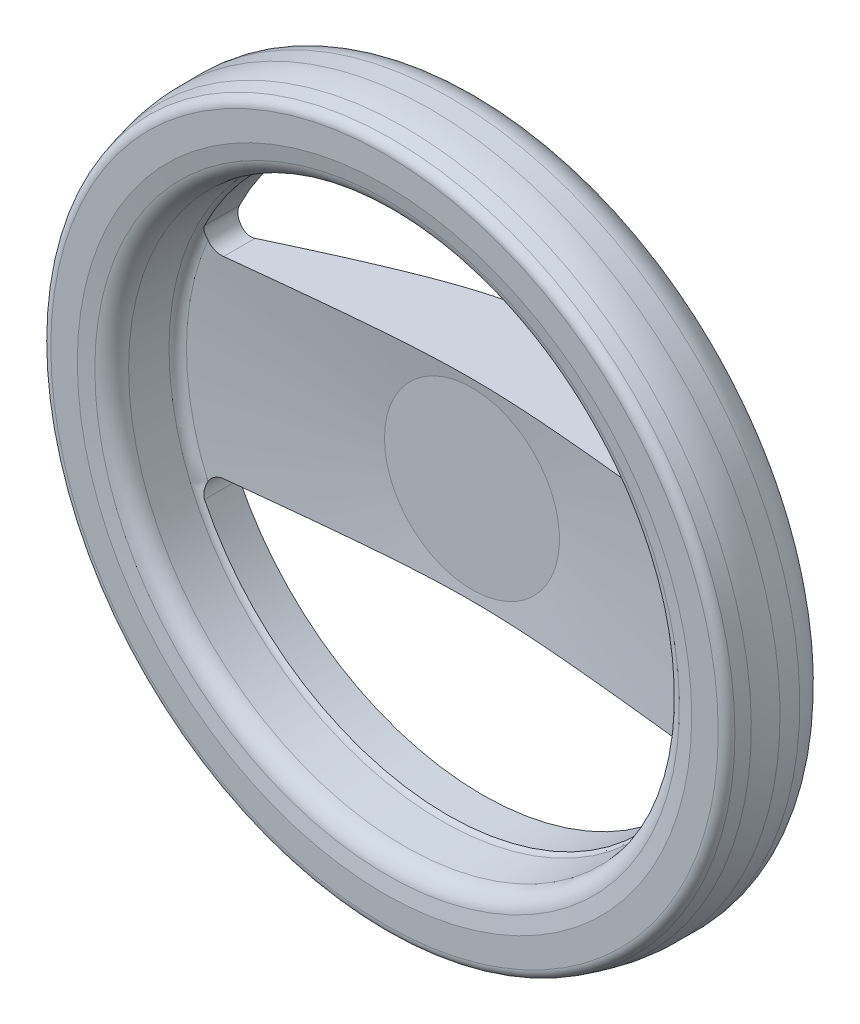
ISO-10303-21;
HEADER;
FILE_DESCRIPTION(('STEP AP214'),'2;1');
FILE_NAME('part.step','',(''),(''),'','','');
FILE_SCHEMA(('AUTOMOTIVE_DESIGN { 1 0 10303 214 1 1 1 1 }'));
ENDSEC;
DATA;
#1=APPLICATION_CONTEXT('core data for automotive mechanical design processes');
#2=APPLICATION_PROTOCOL_DEFINITION('international standard','automotive_design',2000,#1);
#3=PRODUCT_CONTEXT('',#1,'mechanical');
#4=PRODUCT('Part','Part','',(#3));
#5=PRODUCT_RELATED_PRODUCT_CATEGORY('part','',(#4));
#6=PRODUCT_DEFINITION_FORMATION('','',#4);
#7=PRODUCT_DEFINITION_CONTEXT('part definition',#1,'design');
#8=PRODUCT_DEFINITION('design','',#6,#7);
#9=PRODUCT_DEFINITION_SHAPE('','',#8);
#10=(LENGTH_UNIT() NAMED_UNIT(*) SI_UNIT(.MILLI.,.METRE.));
#11=(NAMED_UNIT(*) PLANE_ANGLE_UNIT() SI_UNIT($,.RADIAN.));
#12=(NAMED_UNIT(*) SI_UNIT($,.STERADIAN.) SOLID_ANGLE_UNIT());
#13=UNCERTAINTY_MEASURE_WITH_UNIT(LENGTH_MEASURE(1.E-05),#10,'distance_accuracy_value','');
#14=(GEOMETRIC_REPRESENTATION_CONTEXT(3) GLOBAL_UNCERTAINTY_ASSIGNED_CONTEXT((#13)) GLOBAL_UNIT_ASSIGNED_CONTEXT((#10,
#11,#12)) REPRESENTATION_CONTEXT('',''));
#15=CARTESIAN_POINT('',(0.,0.,0.));
#16=DIRECTION('',(0.,0.,1.));
#17=DIRECTION('',(1.,0.,0.));
#18=AXIS2_PLACEMENT_3D('',#15,#16,#17);
#19=CARTESIAN_POINT('',(-4.24999999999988,0.,34.));
#20=DIRECTION('',(0.,0.,-1.));
#21=DIRECTION('',(0.,1.,0.));
#22=AXIS2_PLACEMENT_3D('',#19,#20,#21);
#23=PLANE('',#22);
#24=CARTESIAN_POINT('',(1.30276191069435E-13,0.,34.));
#25=DIRECTION('',(0.,0.,1.));
#26=DIRECTION('',(-1.,0.,0.));
#27=AXIS2_PLACEMENT_3D('',#24,#25,#26);
#28=CIRCLE('',#27,8.5);
#29=CARTESIAN_POINT('',(-8.49999999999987,0.,34.));
#30=VERTEX_POINT('',#29);
#31=EDGE_CURVE('E497',#30,#30,#28,.F.);
#32=ORIENTED_EDGE('',*,*,#31,.T.);
#33=EDGE_LOOP('',(#32));
#34=FACE_BOUND('',#33,.T.);
#35=ADVANCED_FACE('F14',(#34),#23,.T.);
#36=CARTESIAN_POINT('',(1.30276191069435E-13,0.,34.));
#37=DIRECTION('',(0.,0.,1.));
#38=DIRECTION('',(-1.,0.,0.));
#39=AXIS2_PLACEMENT_3D('',#36,#37,#38);
#40=CONICAL_SURFACE('',#39,8.5,0.785398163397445);
#41=ORIENTED_EDGE('',*,*,#31,.F.);
#42=EDGE_LOOP('',(#41));
#43=FACE_BOUND('',#42,.T.);
#44=CARTESIAN_POINT('',(1.29674049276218E-13,0.,33.5));
#45=DIRECTION('',(0.,0.,1.));
#46=DIRECTION('',(-1.,0.,0.));
#47=AXIS2_PLACEMENT_3D('',#44,#45,#46);
#48=CIRCLE('',#47,8.);
#49=CARTESIAN_POINT('',(-7.99999999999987,0.,33.5));
#50=VERTEX_POINT('',#49);
#51=EDGE_CURVE('E499',#50,#50,#48,.F.);
#52=ORIENTED_EDGE('',*,*,#51,.T.);
#53=EDGE_LOOP('',(#52));
#54=FACE_BOUND('',#53,.T.);
#55=ADVANCED_FACE('F962',(#43,#54),#40,.F.);
#56=CARTESIAN_POINT('',(1.29674049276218E-13,0.,16.85));
#57=DIRECTION('',(0.,0.,1.));
#58=DIRECTION('',(-1.,0.,0.));
#59=AXIS2_PLACEMENT_3D('',#56,#57,#58);
#60=CYLINDRICAL_SURFACE('',#59,8.);
#61=ORIENTED_EDGE('',*,*,#51,.F.);
#62=EDGE_LOOP('',(#61));
#63=FACE_BOUND('',#62,.T.);
#64=CARTESIAN_POINT('',(1.29674049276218E-13,0.,0.200000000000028));
#65=DIRECTION('',(0.,0.,-1.));
#66=DIRECTION('',(-1.,0.,0.));
#67=AXIS2_PLACEMENT_3D('',#64,#65,#66);
#68=CIRCLE('',#67,8.00000000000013);
#69=CARTESIAN_POINT('',(-8.,0.,0.200000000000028));
#70=VERTEX_POINT('',#69);
#71=EDGE_CURVE('E496',#70,#70,#68,.T.);
#72=ORIENTED_EDGE('',*,*,#71,.T.);
#73=EDGE_LOOP('',(#72));
#74=FACE_BOUND('',#73,.T.);
#75=ADVANCED_FACE('F952',(#63,#74),#60,.F.);
#76=CARTESIAN_POINT('',(1.30104260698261E-13,0.,0.));
#77=DIRECTION('',(0.,0.,-1.));
#78=DIRECTION('',(1.,0.,0.));
#79=AXIS2_PLACEMENT_3D('',#76,#77,#78);
#80=CONICAL_SURFACE('',#79,8.20000000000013,0.785398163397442);
#81=ORIENTED_EDGE('',*,*,#71,.F.);
#82=EDGE_LOOP('',(#81));
#83=FACE_BOUND('',#82,.T.);
#84=CARTESIAN_POINT('',(1.30104260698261E-13,0.,0.));
#85=DIRECTION('',(0.,0.,-1.));
#86=DIRECTION('',(1.,0.,0.));
#87=AXIS2_PLACEMENT_3D('',#84,#85,#86);
#88=CIRCLE('',#87,8.20000000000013);
#89=CARTESIAN_POINT('',(8.20000000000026,0.,0.));
#90=VERTEX_POINT('',#89);
#91=EDGE_CURVE('E493',#90,#90,#88,.F.);
#92=ORIENTED_EDGE('',*,*,#91,.F.);
#93=EDGE_LOOP('',(#92));
#94=FACE_BOUND('',#93,.T.);
#95=ADVANCED_FACE('F943',(#83,#94),#80,.F.);
#96=CARTESIAN_POINT('',(-11.6,0.,0.));
#97=DIRECTION('',(0.,0.,-1.));
#98=DIRECTION('',(0.,1.,0.));
#99=AXIS2_PLACEMENT_3D('',#96,#97,#98);
#100=PLANE('',#99);
#101=CARTESIAN_POINT('',(1.29674049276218E-13,0.,0.));
#102=DIRECTION('',(0.,0.,1.));
#103=DIRECTION('',(-1.,0.,0.));
#104=AXIS2_PLACEMENT_3D('',#101,#102,#103);
#105=CIRCLE('',#104,15.);
#106=CARTESIAN_POINT('',(-14.9999999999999,0.,0.));
#107=VERTEX_POINT('',#106);
#108=EDGE_CURVE('E482',#107,#107,#105,.T.);
#109=ORIENTED_EDGE('',*,*,#108,.F.);
#110=EDGE_LOOP('',(#109));
#111=FACE_BOUND('',#110,.T.);
#112=ORIENTED_EDGE('',*,*,#91,.T.);
#113=EDGE_LOOP('',(#112));
#114=FACE_BOUND('',#113,.T.);
#115=ADVANCED_FACE('F937',(#111,#114),#100,.T.);
#116=CARTESIAN_POINT('',(1.29674049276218E-13,0.,0.100000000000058));
#117=DIRECTION('',(0.,0.,1.));
#118=DIRECTION('',(-1.,0.,0.));
#119=AXIS2_PLACEMENT_3D('',#116,#117,#118);
#120=CYLINDRICAL_SURFACE('',#119,15.);
#121=ORIENTED_EDGE('',*,*,#108,.T.);
#122=EDGE_LOOP('',(#121));
#123=FACE_BOUND('',#122,.T.);
#124=CARTESIAN_POINT('',(1.29674049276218E-13,0.,0.20000000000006));
#125=DIRECTION('',(0.,0.,1.));
#126=DIRECTION('',(-1.,0.,0.));
#127=AXIS2_PLACEMENT_3D('',#124,#125,#126);
#128=CIRCLE('',#127,15.);
#129=CARTESIAN_POINT('',(-14.9999999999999,0.,0.20000000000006));
#130=VERTEX_POINT('',#129);
#131=EDGE_CURVE('E475',#130,#130,#128,.T.);
#132=ORIENTED_EDGE('',*,*,#131,.F.);
#133=EDGE_LOOP('',(#132));
#134=FACE_BOUND('',#133,.T.);
#135=ADVANCED_FACE('F379',(#123,#134),#120,.T.);
#136=CARTESIAN_POINT('',(-91.5642015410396,0.,61.));
#137=DIRECTION('',(0.,0.,1.));
#138=DIRECTION('',(-1.,0.,0.));
#139=AXIS2_PLACEMENT_3D('',#136,#137,#138);
#140=PLANE('',#139);
#141=CARTESIAN_POINT('',(1.29519851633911E-13,0.,61.));
#142=DIRECTION('',(0.,0.,1.));
#143=DIRECTION('',(-1.,0.,0.));
#144=AXIS2_PLACEMENT_3D('',#141,#142,#143);
#145=CIRCLE('',#144,87.7777777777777);
#146=CARTESIAN_POINT('',(-87.7777777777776,0.,61.));
#147=VERTEX_POINT('',#146);
#148=EDGE_CURVE('E477',#147,#147,#145,.F.);
#149=ORIENTED_EDGE('',*,*,#148,.T.);
#150=EDGE_LOOP('',(#149));
#151=FACE_BOUND('',#150,.T.);
#152=CARTESIAN_POINT('',(1.38585439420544E-13,0.,61.));
#153=DIRECTION('',(0.,0.,-1.));
#154=DIRECTION('',(0.,-1.,0.));
#155=AXIS2_PLACEMENT_3D('',#152,#153,#154);
#156=CIRCLE('',#155,95.3506253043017);
#157=CARTESIAN_POINT('',(1.50291895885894E-13,-95.3506253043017,61.));
#158=VERTEX_POINT('',#157);
#159=CARTESIAN_POINT('',(-95.3506253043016,0.,61.));
#160=VERTEX_POINT('',#159);
#161=EDGE_CURVE('E474',#158,#160,#156,.T.);
#162=ORIENTED_EDGE('',*,*,#161,.F.);
#163=CARTESIAN_POINT('',(1.38585439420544E-13,0.,61.));
#164=DIRECTION('',(0.,0.,-1.));
#165=DIRECTION('',(0.,1.,0.));
#166=AXIS2_PLACEMENT_3D('',#163,#164,#165);
#167=CIRCLE('',#166,95.3506253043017);
#168=CARTESIAN_POINT('',(1.32183646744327E-13,95.3506253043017,61.));
#169=VERTEX_POINT('',#168);
#170=EDGE_CURVE('E394',#169,#158,#167,.T.);
#171=ORIENTED_EDGE('',*,*,#170,.F.);
#172=CARTESIAN_POINT('',(1.38585439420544E-13,0.,61.));
#173=DIRECTION('',(0.,0.,-1.));
#174=DIRECTION('',(-1.,0.,0.));
#175=AXIS2_PLACEMENT_3D('',#172,#173,#174);
#176=CIRCLE('',#175,95.3506253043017);
#177=EDGE_CURVE('E357',#160,#169,#176,.T.);
#178=ORIENTED_EDGE('',*,*,#177,.F.);
#179=EDGE_LOOP('',(#162,#171,#178));
#180=FACE_BOUND('',#179,.T.);
#181=ADVANCED_FACE('F368',(#151,#180),#140,.T.);
#182=CARTESIAN_POINT('',(1.29519851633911E-13,0.,61.));
#183=DIRECTION('',(0.,0.,1.));
#184=DIRECTION('',(-1.,0.,0.));
#185=AXIS2_PLACEMENT_3D('',#182,#183,#184);
#186=CONICAL_SURFACE('',#185,87.7777777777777,1.39626340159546);
#187=CARTESIAN_POINT('',(1.40307336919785E-13,0.,60.2477496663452));
#188=DIRECTION('',(0.,0.,-1.));
#189=DIRECTION('',(0.,1.,0.));
#190=AXIS2_PLACEMENT_3D('',#187,#188,#189);
#191=CIRCLE('',#190,83.5115541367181);
#192=CARTESIAN_POINT('',(1.40307336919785E-13,83.5115541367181,60.2477496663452));
#193=VERTEX_POINT('',#192);
#194=EDGE_CURVE('E353',#193,#193,#191,.F.);
#195=ORIENTED_EDGE('',*,*,#194,.F.);
#196=EDGE_LOOP('',(#195));
#197=FACE_BOUND('',#196,.T.);
#198=ORIENTED_EDGE('',*,*,#148,.F.);
#199=EDGE_LOOP('',(#198));
#200=FACE_BOUND('',#199,.T.);
#201=ADVANCED_FACE('F378',(#197,#200),#186,.F.);
#202=CARTESIAN_POINT('',(-19.75,0.,0.200000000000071));
#203=DIRECTION('',(0.,0.,-1.));
#204=DIRECTION('',(0.,1.,0.));
#205=AXIS2_PLACEMENT_3D('',#202,#203,#204);
#206=PLANE('',#205);
#207=CARTESIAN_POINT('',(1.30419132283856E-13,0.,0.200000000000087));
#208=DIRECTION('',(0.,0.,1.));
#209=DIRECTION('',(0.,-1.,0.));
#210=AXIS2_PLACEMENT_3D('',#207,#208,#209);
#211=CIRCLE('',#210,24.5);
#212=CARTESIAN_POINT('',(1.33075408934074E-13,-24.5,0.200000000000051));
#213=VERTEX_POINT('',#212);
#214=CARTESIAN_POINT('',(1.29887458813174E-13,24.5,0.200000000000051));
#215=VERTEX_POINT('',#214);
#216=EDGE_CURVE('E356',#213,#215,#211,.T.);
#217=ORIENTED_EDGE('',*,*,#216,.F.);
#218=CARTESIAN_POINT('',(1.30419132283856E-13,0.,0.200000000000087));
#219=DIRECTION('',(0.,0.,1.));
#220=DIRECTION('',(-1.,0.,0.));
#221=AXIS2_PLACEMENT_3D('',#218,#219,#220);
#222=CIRCLE('',#221,24.5);
#223=CARTESIAN_POINT('',(-24.5,0.,0.200000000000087));
#224=VERTEX_POINT('',#223);
#225=EDGE_CURVE('E429',#224,#213,#222,.T.);
#226=ORIENTED_EDGE('',*,*,#225,.F.);
#227=CARTESIAN_POINT('',(1.30419132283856E-13,0.,0.200000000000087));
#228=DIRECTION('',(0.,0.,1.));
#229=DIRECTION('',(0.,1.,0.));
#230=AXIS2_PLACEMENT_3D('',#227,#228,#229);
#231=CIRCLE('',#230,24.5);
#232=EDGE_CURVE('E433',#215,#224,#231,.T.);
#233=ORIENTED_EDGE('',*,*,#232,.F.);
#234=EDGE_LOOP('',(#217,#226,#233));
#235=FACE_BOUND('',#234,.T.);
#236=ORIENTED_EDGE('',*,*,#131,.T.);
#237=EDGE_LOOP('',(#236));
#238=FACE_BOUND('',#237,.T.);
#239=ADVANCED_FACE('F418',(#235,#238),#206,.T.);
#240=CARTESIAN_POINT('',(1.38585439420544E-13,0.,58.2));
#241=DIRECTION('',(0.,0.,-1.));
#242=DIRECTION('',(0.,1.,0.));
#243=AXIS2_PLACEMENT_3D('',#240,#241,#242);
#244=TOROIDAL_SURFACE('',#243,95.3506253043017,2.8);
#245=CARTESIAN_POINT('',(1.29674049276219E-13,0.,58.9246933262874));
#246=DIRECTION('',(0.,0.,-1.));
#247=DIRECTION('',(-1.,0.,0.));
#248=AXIS2_PLACEMENT_3D('',#245,#246,#247);
#249=CIRCLE('',#248,98.055217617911);
#250=CARTESIAN_POINT('',(-98.0552176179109,0.,58.9246933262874));
#251=VERTEX_POINT('',#250);
#252=EDGE_CURVE('E426',#251,#251,#249,.T.);
#253=ORIENTED_EDGE('',*,*,#252,.F.);
#254=EDGE_LOOP('',(#253));
#255=FACE_BOUND('',#254,.T.);
#256=ORIENTED_EDGE('',*,*,#161,.T.);
#257=ORIENTED_EDGE('',*,*,#177,.T.);
#258=ORIENTED_EDGE('',*,*,#170,.T.);
#259=EDGE_LOOP('',(#256,#257,#258));
#260=FACE_BOUND('',#259,.T.);
#261=ADVANCED_FACE('F409',(#255,#260),#244,.T.);
#262=CARTESIAN_POINT('',(1.40307336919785E-13,0.,54.7328262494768));
#263=DIRECTION('',(0.,0.,-1.));
#264=DIRECTION('',(0.,1.,0.));
#265=AXIS2_PLACEMENT_3D('',#262,#263,#264);
#266=TOROIDAL_SURFACE('',#265,84.483983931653,5.6);
#267=CARTESIAN_POINT('',(1.29674049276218E-13,0.,55.2208984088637));
#268=DIRECTION('',(0.,0.,1.));
#269=DIRECTION('',(-1.,0.,0.));
#270=AXIS2_PLACEMENT_3D('',#267,#268,#269);
#271=CIRCLE('',#270,78.9052936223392);
#272=CARTESIAN_POINT('',(-78.9052936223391,0.,55.2208984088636));
#273=VERTEX_POINT('',#272);
#274=EDGE_CURVE('E319',#273,#273,#271,.F.);
#275=ORIENTED_EDGE('',*,*,#274,.T.);
#276=EDGE_LOOP('',(#275));
#277=FACE_BOUND('',#276,.T.);
#278=ORIENTED_EDGE('',*,*,#194,.T.);
#279=EDGE_LOOP('',(#278));
#280=FACE_BOUND('',#279,.T.);
#281=ADVANCED_FACE('F328',(#277,#280),#266,.T.);
#282=CARTESIAN_POINT('',(1.30419132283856E-13,0.,0.700000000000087));
#283=DIRECTION('',(0.,0.,-1.));
#284=DIRECTION('',(0.,1.,0.));
#285=AXIS2_PLACEMENT_3D('',#282,#283,#284);
#286=TOROIDAL_SURFACE('',#285,24.5,0.5);
#287=ORIENTED_EDGE('',*,*,#216,.T.);
#288=ORIENTED_EDGE('',*,*,#232,.T.);
#289=ORIENTED_EDGE('',*,*,#225,.T.);
#290=EDGE_LOOP('',(#287,#288,#289));
#291=FACE_BOUND('',#290,.T.);
#292=CARTESIAN_POINT('',(1.29674049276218E-13,0.,0.700000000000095));
#293=DIRECTION('',(0.,0.,1.));
#294=DIRECTION('',(-1.,0.,0.));
#295=AXIS2_PLACEMENT_3D('',#292,#293,#294);
#296=CIRCLE('',#295,25.);
#297=CARTESIAN_POINT('',(-24.9999999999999,0.,0.700000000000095));
#298=VERTEX_POINT('',#297);
#299=EDGE_CURVE('E316',#298,#298,#296,.T.);
#300=ORIENTED_EDGE('',*,*,#299,.F.);
#301=EDGE_LOOP('',(#300));
#302=FACE_BOUND('',#301,.T.);
#303=ADVANCED_FACE('F322',(#291,#302),#286,.T.);
#304=CARTESIAN_POINT('',(1.29543047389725E-13,0.,55.2273299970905));
#305=DIRECTION('',(0.,0.,-1.));
#306=DIRECTION('',(1.,0.,0.));
#307=AXIS2_PLACEMENT_3D('',#304,#305,#306);
#308=CONICAL_SURFACE('',#307,99.0459231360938,0.261799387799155);
#309=CARTESIAN_POINT('',(1.30195556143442E-13,0.,55.2273299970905));
#310=DIRECTION('',(0.,0.,-1.));
#311=DIRECTION('',(0.,1.,0.));
#312=AXIS2_PLACEMENT_3D('',#309,#310,#311);
#313=CIRCLE('',#312,99.0459231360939);
#314=CARTESIAN_POINT('',(1.30195556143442E-13,99.0459231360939,55.2273299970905));
#315=VERTEX_POINT('',#314);
#316=EDGE_CURVE('E151',#315,#315,#313,.T.);
#317=ORIENTED_EDGE('',*,*,#316,.F.);
#318=EDGE_LOOP('',(#317));
#319=FACE_BOUND('',#318,.T.);
#320=ORIENTED_EDGE('',*,*,#252,.T.);
#321=EDGE_LOOP('',(#320));
#322=FACE_BOUND('',#321,.T.);
#323=ADVANCED_FACE('F327',(#319,#322),#308,.T.);
#324=CARTESIAN_POINT('',(-12.4999999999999,0.,36.));
#325=DIRECTION('',(0.,0.,1.));
#326=DIRECTION('',(-1.,0.,0.));
#327=AXIS2_PLACEMENT_3D('',#324,#325,#326);
#328=PLANE('',#327);
#329=CARTESIAN_POINT('',(1.30581280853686E-13,0.,36.));
#330=DIRECTION('',(0.,0.,1.));
#331=DIRECTION('',(-1.,0.,0.));
#332=AXIS2_PLACEMENT_3D('',#329,#330,#331);
#333=CIRCLE('',#332,25.);
#334=CARTESIAN_POINT('',(-24.9999999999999,0.,36.));
#335=VERTEX_POINT('',#334);
#336=EDGE_CURVE('E313',#335,#335,#333,.T.);
#337=ORIENTED_EDGE('',*,*,#336,.T.);
#338=EDGE_LOOP('',(#337));
#339=FACE_BOUND('',#338,.T.);
#340=ADVANCED_FACE('F652',(#339),#328,.T.);
#341=CARTESIAN_POINT('',(1.29519880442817E-13,0.,55.2208984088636));
#342=DIRECTION('',(0.,0.,1.));
#343=DIRECTION('',(-1.,0.,0.));
#344=AXIS2_PLACEMENT_3D('',#341,#342,#343);
#345=CONICAL_SURFACE('',#344,78.9052936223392,0.0872664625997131);
#346=CARTESIAN_POINT('',(1.33103457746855E-13,0.,44.5984443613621));
#347=DIRECTION('',(0.,0.,-1.));
#348=DIRECTION('',(0.,1.,0.));
#349=AXIS2_PLACEMENT_3D('',#346,#347,#348);
#350=CIRCLE('',#349,77.9759493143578);
#351=CARTESIAN_POINT('',(1.33103457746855E-13,77.9759493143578,44.5984443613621));
#352=VERTEX_POINT('',#351);
#353=EDGE_CURVE('E310',#352,#352,#350,.T.);
#354=ORIENTED_EDGE('',*,*,#353,.T.);
#355=EDGE_LOOP('',(#354));
#356=FACE_BOUND('',#355,.T.);
#357=ORIENTED_EDGE('',*,*,#274,.F.);
#358=EDGE_LOOP('',(#357));
#359=FACE_BOUND('',#358,.T.);
#360=ADVANCED_FACE('F649',(#356,#359),#345,.F.);
#361=CARTESIAN_POINT('',(1.29674049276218E-13,0.,4.85000000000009));
#362=DIRECTION('',(0.,0.,1.));
#363=DIRECTION('',(-1.,0.,0.));
#364=AXIS2_PLACEMENT_3D('',#361,#362,#363);
#365=CYLINDRICAL_SURFACE('',#364,25.);
#366=CARTESIAN_POINT('',(1.29674049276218E-13,0.,9.00000000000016));
#367=DIRECTION('',(0.,0.,1.));
#368=DIRECTION('',(-1.,0.,0.));
#369=AXIS2_PLACEMENT_3D('',#366,#367,#368);
#370=CIRCLE('',#369,25.);
#371=CARTESIAN_POINT('',(-24.9999999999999,0.,9.00000000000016));
#372=VERTEX_POINT('',#371);
#373=EDGE_CURVE('E234',#372,#372,#370,.T.);
#374=ORIENTED_EDGE('',*,*,#373,.F.);
#375=EDGE_LOOP('',(#374));
#376=FACE_BOUND('',#375,.T.);
#377=ORIENTED_EDGE('',*,*,#299,.T.);
#378=EDGE_LOOP('',(#377));
#379=FACE_BOUND('',#378,.T.);
#380=ADVANCED_FACE('F644',(#376,#379),#365,.T.);
#381=CARTESIAN_POINT('',(1.30195556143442E-13,0.,47.9803967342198));
#382=DIRECTION('',(0.,0.,-1.));
#383=DIRECTION('',(0.,1.,0.));
#384=AXIS2_PLACEMENT_3D('',#381,#382,#383);
#385=TOROIDAL_SURFACE('',#384,72.,27.9999999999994);
#386=ORIENTED_EDGE('',*,*,#316,.T.);
#387=EDGE_LOOP('',(#386));
#388=FACE_BOUND('',#387,.T.);
#389=CARTESIAN_POINT('',(1.29674049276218E-13,0.,47.98039673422));
#390=DIRECTION('',(0.,0.,1.));
#391=DIRECTION('',(-1.,0.,0.));
#392=AXIS2_PLACEMENT_3D('',#389,#390,#391);
#393=CIRCLE('',#392,100.);
#394=CARTESIAN_POINT('',(-99.9999999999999,0.,47.98039673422));
#395=VERTEX_POINT('',#394);
#396=EDGE_CURVE('E228',#395,#395,#393,.F.);
#397=ORIENTED_EDGE('',*,*,#396,.F.);
#398=EDGE_LOOP('',(#397));
#399=FACE_BOUND('',#398,.T.);
#400=ADVANCED_FACE('F641',(#388,#399),#385,.T.);
#401=CARTESIAN_POINT('',(-65.4485389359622,-27.5,2.3574936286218E-13));
#402=DIRECTION('',(0.,1.,0.));
#403=DIRECTION('',(-1.,0.,0.));
#404=AXIS2_PLACEMENT_3D('',#401,#402,#403);
#405=PLANE('',#404);
#406=DIRECTION('',(0.,0.,-1.));
#407=VECTOR('',#406,1.);
#408=CARTESIAN_POINT('',(-65.4485389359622,-27.5,2.3574936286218E-13));
#409=LINE('',#408,#407);
#410=CARTESIAN_POINT('',(-65.448538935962,-27.5,41.5189531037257));
#411=VERTEX_POINT('',#410);
#412=CARTESIAN_POINT('',(-65.4485389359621,-27.5,32.5185905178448));
#413=VERTEX_POINT('',#412);
#414=EDGE_CURVE('E225',#411,#413,#409,.T.);
#415=ORIENTED_EDGE('',*,*,#414,.T.);
#416=CARTESIAN_POINT('',(-65.1459129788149,-27.5,32.3854886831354));
#417=CARTESIAN_POINT('',(-65.1957730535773,-27.5,32.4089855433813));
#418=CARTESIAN_POINT('',(-65.2459219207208,-27.5,32.4318257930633));
#419=CARTESIAN_POINT('',(-65.3467972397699,-27.5,32.4761930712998));
#420=CARTESIAN_POINT('',(-65.3975236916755,-27.5,32.4977200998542));
#421=CARTESIAN_POINT('',(-65.4485389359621,-27.5,32.5185905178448));
#422=B_SPLINE_CURVE_WITH_KNOTS('',3,(#416,#417,#418,#419,#420,#421),.UNSPECIFIED.,.F.,.F.,(4,2,
4),(0.,0.165315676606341,0.330631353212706),.UNSPECIFIED.);
#423=CARTESIAN_POINT('',(-65.1459129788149,-27.5,32.3854886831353));
#424=VERTEX_POINT('',#423);
#425=EDGE_CURVE('E150',#424,#413,#422,.T.);
#426=ORIENTED_EDGE('',*,*,#425,.F.);
#427=CARTESIAN_POINT('',(65.1459129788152,-27.5,32.3854886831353));
#428=CARTESIAN_POINT('',(64.3044228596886,-27.5,31.9888921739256));
#429=CARTESIAN_POINT('',(63.4624882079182,-27.5,31.593239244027));
#430=CARTESIAN_POINT('',(61.7776267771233,-27.5,30.8040465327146));
#431=CARTESIAN_POINT('',(60.9346999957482,-27.5,30.4105067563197));
#432=CARTESIAN_POINT('',(58.4042021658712,-27.5,29.2333614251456));
#433=CARTESIAN_POINT('',(56.7149941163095,-27.5,28.4532678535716));
#434=CARTESIAN_POINT('',(53.3281055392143,-27.5,26.9033982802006));
#435=CARTESIAN_POINT('',(51.6304151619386,-27.5,26.1336437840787));
#436=CARTESIAN_POINT('',(48.2283363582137,-27.5,24.6091370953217));
#437=CARTESIAN_POINT('',(46.5239480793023,-27.5,23.8543845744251));
#438=CARTESIAN_POINT('',(43.9054283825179,-27.5,22.7126429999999));
#439=CARTESIAN_POINT('',(42.9943399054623,-27.5,22.3186733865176));
#440=CARTESIAN_POINT('',(41.1694105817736,-27.5,21.537150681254));
#441=CARTESIAN_POINT('',(40.2555697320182,-27.5,21.1495975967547));
#442=CARTESIAN_POINT('',(38.4246869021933,-27.5,20.3819223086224));
#443=CARTESIAN_POINT('',(37.5076446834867,-27.5,20.0018006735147));
#444=CARTESIAN_POINT('',(35.6699863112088,-27.5,19.2502899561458));
#445=CARTESIAN_POINT('',(34.7493701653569,-27.5,18.8789008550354));
#446=CARTESIAN_POINT('',(32.9045046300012,-27.5,18.146575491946));
#447=CARTESIAN_POINT('',(31.9802572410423,-27.5,17.7856341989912));
#448=CARTESIAN_POINT('',(30.1270924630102,-27.5,17.0758885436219));
#449=CARTESIAN_POINT('',(29.1981750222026,-27.5,16.7270843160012));
#450=CARTESIAN_POINT('',(27.3351516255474,-27.5,16.0439515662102));
#451=CARTESIAN_POINT('',(26.4010463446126,-27.5,15.7096212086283));
#452=CARTESIAN_POINT('',(24.5268629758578,-27.5,15.0581961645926));
#453=CARTESIAN_POINT('',(23.586785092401,-27.5,14.7411008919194));
#454=CARTESIAN_POINT('',(21.6204680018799,-27.5,14.1016852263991));
#455=CARTESIAN_POINT('',(20.593637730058,-27.5,13.781172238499));
#456=CARTESIAN_POINT('',(18.5311936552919,-27.5,13.1695737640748));
#457=CARTESIAN_POINT('',(17.495579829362,-27.5,12.8784883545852));
#458=CARTESIAN_POINT('',(15.4150783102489,-27.5,12.3319870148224));
#459=CARTESIAN_POINT('',(14.3701921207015,-27.5,12.0765654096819));
#460=CARTESIAN_POINT('',(12.2708338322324,-27.5,11.6083832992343));
#461=CARTESIAN_POINT('',(11.2163618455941,-27.5,11.3956222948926));
#462=CARTESIAN_POINT('',(9.12161321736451,-27.5,11.0243460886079));
#463=CARTESIAN_POINT('',(8.08153309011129,-27.5,10.8647426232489));
#464=CARTESIAN_POINT('',(6.51628905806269,-27.5,10.6661945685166));
#465=CARTESIAN_POINT('',(5.99366823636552,-27.5,10.6068200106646));
#466=CARTESIAN_POINT('',(4.94700865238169,-27.5,10.5023576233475));
#467=CARTESIAN_POINT('',(4.42296995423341,-27.5,10.4572691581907));
#468=CARTESIAN_POINT('',(3.37416162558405,-27.5,10.3819606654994));
#469=CARTESIAN_POINT('',(2.849392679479,-27.5,10.3517311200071));
#470=CARTESIAN_POINT('',(1.79919642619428,-27.5,10.3064839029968));
#471=CARTESIAN_POINT('',(1.27376911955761,-27.5,10.2914662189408));
#472=CARTESIAN_POINT('',(0.222701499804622,-27.5,10.2768415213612));
#473=CARTESIAN_POINT('',(-0.302938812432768,-27.5,10.2772344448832));
#474=CARTESIAN_POINT('',(-1.3539813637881,-27.5,10.2934254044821));
#475=CARTESIAN_POINT('',(-1.87938360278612,-27.5,10.3092234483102));
#476=CARTESIAN_POINT('',(-2.93099791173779,-27.5,10.3560827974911));
#477=CARTESIAN_POINT('',(-3.45720805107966,-27.5,10.3871872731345));
#478=CARTESIAN_POINT('',(-4.50855603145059,-27.5,10.4642797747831));
#479=CARTESIAN_POINT('',(-5.03369382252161,-27.5,10.5102684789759));
#480=CARTESIAN_POINT('',(-6.08250569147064,-27.5,10.6165628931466));
#481=CARTESIAN_POINT('',(-6.60617979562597,-27.5,10.676868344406));
#482=CARTESIAN_POINT('',(-7.65178769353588,-27.5,10.8110972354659));
#483=CARTESIAN_POINT('',(-8.17372141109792,-27.5,10.8850212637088));
#484=CARTESIAN_POINT('',(-9.73750935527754,-27.5,11.1261978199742));
#485=CARTESIAN_POINT('',(-10.7764261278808,-27.5,11.31275858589));
#486=CARTESIAN_POINT('',(-12.8451358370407,-27.5,11.7303782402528));
#487=CARTESIAN_POINT('',(-13.8749286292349,-27.5,11.9614378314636));
#488=CARTESIAN_POINT('',(-15.9483177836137,-27.5,12.4667412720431));
#489=CARTESIAN_POINT('',(-16.9917047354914,-27.5,12.7418384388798));
#490=CARTESIAN_POINT('',(-19.0692707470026,-27.5,13.3245988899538));
#491=CARTESIAN_POINT('',(-20.1034498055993,-27.5,13.6322621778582));
#492=CARTESIAN_POINT('',(-22.1629989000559,-27.5,14.27427777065));
#493=CARTESIAN_POINT('',(-23.188372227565,-27.5,14.6086195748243));
#494=CARTESIAN_POINT('',(-25.231690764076,-27.5,15.299346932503));
#495=CARTESIAN_POINT('',(-26.2496356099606,-27.5,15.6557335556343));
#496=CARTESIAN_POINT('',(-28.0954219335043,-27.5,16.3205560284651));
#497=CARTESIAN_POINT('',(-28.924344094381,-27.5,16.6260048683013));
#498=CARTESIAN_POINT('',(-30.5782682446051,-27.5,17.2473427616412));
#499=CARTESIAN_POINT('',(-31.4032702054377,-27.5,17.5632318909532));
#500=CARTESIAN_POINT('',(-33.0498171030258,-27.5,18.2039881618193));
#501=CARTESIAN_POINT('',(-33.871361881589,-27.5,18.5288557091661));
#502=CARTESIAN_POINT('',(-35.5113522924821,-27.5,19.1863263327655));
#503=CARTESIAN_POINT('',(-36.3297979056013,-27.5,19.5189294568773));
#504=CARTESIAN_POINT('',(-37.9642043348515,-27.5,20.1909457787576));
#505=CARTESIAN_POINT('',(-38.7801642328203,-27.5,20.5303612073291));
#506=CARTESIAN_POINT('',(-40.4096316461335,-27.5,21.2150307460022));
#507=CARTESIAN_POINT('',(-41.2231391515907,-27.5,21.560284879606));
#508=CARTESIAN_POINT('',(-43.660341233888,-27.5,22.6036472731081));
#509=CARTESIAN_POINT('',(-45.2807736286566,-27.5,23.3093796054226));
#510=CARTESIAN_POINT('',(-48.4288956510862,-27.5,24.6986749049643));
#511=CARTESIAN_POINT('',(-49.956944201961,-27.5,25.3814273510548));
#512=CARTESIAN_POINT('',(-53.0079828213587,-27.5,26.7581713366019));
#513=CARTESIAN_POINT('',(-54.5309728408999,-27.5,27.4521629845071));
#514=CARTESIAN_POINT('',(-57.5712717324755,-27.5,28.8485162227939));
#515=CARTESIAN_POINT('',(-59.088584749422,-27.5,29.5508687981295));
#516=CARTESIAN_POINT('',(-61.3619435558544,-27.5,30.6099421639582));
#517=CARTESIAN_POINT('',(-62.1192849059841,-27.5,30.9638860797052));
#518=CARTESIAN_POINT('',(-63.6331750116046,-27.5,31.6734618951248));
#519=CARTESIAN_POINT('',(-64.3897237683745,-27.5,32.0290937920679));
#520=CARTESIAN_POINT('',(-65.145912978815,-27.5,32.3854886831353));
#521=B_SPLINE_CURVE_WITH_KNOTS('',3,(#427,#428,#429,#430,#431,#432,#433,#434,#435,#436,#437,
#438,#439,#440,#441,#442,#443,#444,#445,#446,#447,#448,#449,#450,#451,#452,#453,#454,#455,#456,
#457,#458,#459,#460,#461,#462,#463,#464,#465,#466,#467,#468,#469,#470,#471,#472,#473,#474,#475,
#476,#477,#478,#479,#480,#481,#482,#483,#484,#485,#486,#487,#488,#489,#490,#491,#492,#493,#494,
#495,#496,#497,#498,#499,#500,#501,#502,#503,#504,#505,#506,#507,#508,#509,#510,#511,#512,#513,
#514,#515,#516,#517,#518,#519,#520),.UNSPECIFIED.,.F.,.F.,(4,2,2,2,2,2,2,2,2,2,2,2,2,2,2,2,2,2,
2,2,2,2,2,2,2,2,2,2,2,2,2,2,2,2,2,2,2,2,2,2,2,2,2,2,2,2,4),(0.,2.79079607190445,
5.58159876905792,11.1634711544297,16.7555634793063,22.3475333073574,25.3253734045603,
28.3032168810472,31.2812872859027,34.2593512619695,37.2359565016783,40.2125947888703,
43.188854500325,46.1650129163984,49.3917186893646,52.6184329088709,55.8446331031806,
59.0707955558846,62.2261382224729,63.8039227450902,65.38163705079,66.9583394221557,
68.5350404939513,70.1117351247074,71.6884305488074,73.2695985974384,74.8508387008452,
76.4320502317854,78.0133301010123,81.1786743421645,84.3440685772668,87.5805534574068,
90.8170387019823,94.0522562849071,97.2876309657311,99.9377814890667,102.587951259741,
105.238241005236,107.888547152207,110.539735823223,113.190935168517,118.49314477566,
123.514025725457,128.534955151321,133.550888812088,136.058790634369,138.566688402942),.UNSPECIFIED.);
#522=CARTESIAN_POINT('',(65.1459129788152,-27.5,32.3854886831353));
#523=VERTEX_POINT('',#522);
#524=EDGE_CURVE('E146',#523,#424,#521,.T.);
#525=ORIENTED_EDGE('',*,*,#524,.F.);
#526=CARTESIAN_POINT('',(65.4485389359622,-27.5,32.5185905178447));
#527=CARTESIAN_POINT('',(65.3975236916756,-27.5,32.4977200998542));
#528=CARTESIAN_POINT('',(65.34679723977,-27.5,32.4761930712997));
#529=CARTESIAN_POINT('',(65.245921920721,-27.5,32.4318257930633));
#530=CARTESIAN_POINT('',(65.1957730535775,-27.5,32.4089855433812));
#531=CARTESIAN_POINT('',(65.1459129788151,-27.5,32.3854886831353));
#532=B_SPLINE_CURVE_WITH_KNOTS('',3,(#526,#527,#528,#529,#530,#531),.UNSPECIFIED.,.F.,.F.,(4,2,
4),(0.,0.165315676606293,0.330631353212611),.UNSPECIFIED.);
#533=CARTESIAN_POINT('',(65.4485389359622,-27.5,32.5185905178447));
#534=VERTEX_POINT('',#533);
#535=EDGE_CURVE('E138',#534,#523,#532,.T.);
#536=ORIENTED_EDGE('',*,*,#535,.F.);
#537=DIRECTION('',(0.,0.,-1.));
#538=VECTOR('',#537,1.);
#539=CARTESIAN_POINT('',(65.4485389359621,-27.5,-2.35749362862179E-13));
#540=LINE('',#539,#538);
#541=CARTESIAN_POINT('',(65.4485389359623,-27.5,41.5189531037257));
#542=VERTEX_POINT('',#541);
#543=EDGE_CURVE('E142',#534,#542,#540,.F.);
#544=ORIENTED_EDGE('',*,*,#543,.T.);
#545=CARTESIAN_POINT('',(65.4485389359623,-27.5,41.5189531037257));
#546=CARTESIAN_POINT('',(64.0784570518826,-27.5,41.3673905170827));
#547=CARTESIAN_POINT('',(62.7082989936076,-27.5,41.2165130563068));
#548=CARTESIAN_POINT('',(59.9677988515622,-27.5,40.9164259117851));
#549=CARTESIAN_POINT('',(58.5974567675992,-27.5,40.7672162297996));
#550=CARTESIAN_POINT('',(55.8565314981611,-27.5,40.4707594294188));
#551=CARTESIAN_POINT('',(54.4859483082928,-27.5,40.3235123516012));
#552=CARTESIAN_POINT('',(51.7445308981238,-27.5,40.0313743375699));
#553=CARTESIAN_POINT('',(50.3736966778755,-27.5,39.8864834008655));
#554=CARTESIAN_POINT('',(47.6277289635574,-27.5,39.599124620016));
#555=CARTESIAN_POINT('',(46.252594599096,-27.5,39.4566650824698));
#556=CARTESIAN_POINT('',(43.5019698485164,-27.5,39.1752270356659));
#557=CARTESIAN_POINT('',(42.1264794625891,-27.5,39.0362485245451));
#558=CARTESIAN_POINT('',(39.3750744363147,-27.5,38.7625669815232));
#559=CARTESIAN_POINT('',(37.9991597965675,-27.5,38.6278639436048));
#560=CARTESIAN_POINT('',(35.2468207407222,-27.5,38.3637519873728));
#561=CARTESIAN_POINT('',(33.8703963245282,-27.5,38.2343430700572));
#562=CARTESIAN_POINT('',(31.1266139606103,-27.5,37.9830148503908));
#563=CARTESIAN_POINT('',(29.7592602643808,-27.5,37.8610493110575));
#564=CARTESIAN_POINT('',(27.0238460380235,-27.5,37.6252684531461));
#565=CARTESIAN_POINT('',(25.6557855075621,-27.5,37.5114531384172));
#566=CARTESIAN_POINT('',(22.9187912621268,-27.5,37.2940365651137));
#567=CARTESIAN_POINT('',(21.5498575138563,-27.5,37.190435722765));
#568=CARTESIAN_POINT('',(18.8110742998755,-27.5,36.9959963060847));
#569=CARTESIAN_POINT('',(17.44122483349,-27.5,36.9051577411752));
#570=CARTESIAN_POINT('',(14.7027216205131,-27.5,36.7393539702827));
#571=CARTESIAN_POINT('',(13.3340693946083,-27.5,36.664363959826));
#572=CARTESIAN_POINT('',(10.5958639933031,-27.5,36.5332773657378));
#573=CARTESIAN_POINT('',(9.22631083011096,-27.5,36.4771805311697));
#574=CARTESIAN_POINT('',(6.48663784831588,-27.5,36.3868790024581));
#575=CARTESIAN_POINT('',(5.11651812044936,-27.5,36.3526716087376));
#576=CARTESIAN_POINT('',(2.37588745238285,-27.5,36.3082863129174));
#577=CARTESIAN_POINT('',(1.00537651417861,-27.5,36.2981082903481));
#578=CARTESIAN_POINT('',(-1.72049990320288,-27.5,36.302449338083));
#579=CARTESIAN_POINT('',(-3.07586583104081,-27.5,36.3166974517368));
#580=CARTESIAN_POINT('',(-5.78615141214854,-27.5,36.3684285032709));
#581=CARTESIAN_POINT('',(-7.1410710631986,-27.5,36.4059115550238));
#582=CARTESIAN_POINT('',(-9.85032717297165,-27.5,36.5018659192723));
#583=CARTESIAN_POINT('',(-11.2046635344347,-27.5,36.5603399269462));
#584=CARTESIAN_POINT('',(-13.9124275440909,-27.5,36.6953132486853));
#585=CARTESIAN_POINT('',(-15.2658551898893,-27.5,36.7718126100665));
#586=CARTESIAN_POINT('',(-17.9739001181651,-27.5,36.9398857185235));
#587=CARTESIAN_POINT('',(-19.3285159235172,-27.5,37.0314829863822));
#588=CARTESIAN_POINT('',(-22.0368620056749,-27.5,37.2268316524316));
#589=CARTESIAN_POINT('',(-23.3905922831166,-27.5,37.3305830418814));
#590=CARTESIAN_POINT('',(-26.0972050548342,-27.5,37.5478293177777));
#591=CARTESIAN_POINT('',(-27.4500875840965,-27.5,37.6613237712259));
#592=CARTESIAN_POINT('',(-30.1551722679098,-27.5,37.8961063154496));
#593=CARTESIAN_POINT('',(-31.5073744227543,-27.5,38.0173944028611));
#594=CARTESIAN_POINT('',(-34.2206632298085,-27.5,38.2670850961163));
#595=CARTESIAN_POINT('',(-35.5817458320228,-27.5,38.3955315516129));
#596=CARTESIAN_POINT('',(-38.303419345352,-27.5,38.6575157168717));
#597=CARTESIAN_POINT('',(-39.6640102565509,-27.5,38.7910534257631));
#598=CARTESIAN_POINT('',(-42.3847856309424,-27.5,39.0622528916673));
#599=CARTESIAN_POINT('',(-43.7449700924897,-27.5,39.1999146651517));
#600=CARTESIAN_POINT('',(-46.4649941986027,-27.5,39.4786050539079));
#601=CARTESIAN_POINT('',(-47.8248338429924,-27.5,39.6196336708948));
#602=CARTESIAN_POINT('',(-50.5403478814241,-27.5,39.9040569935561));
#603=CARTESIAN_POINT('',(-51.8960231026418,-27.5,40.0474438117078));
#604=CARTESIAN_POINT('',(-54.6071293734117,-27.5,40.3365079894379));
#605=CARTESIAN_POINT('',(-55.9625604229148,-27.5,40.4821853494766));
#606=CARTESIAN_POINT('',(-58.6731849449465,-27.5,40.7754520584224));
#607=CARTESIAN_POINT('',(-60.0283784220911,-27.5,40.9230413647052));
#608=CARTESIAN_POINT('',(-62.7385857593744,-27.5,41.2198479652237));
#609=CARTESIAN_POINT('',(-64.0935996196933,-27.5,41.3690652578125));
#610=CARTESIAN_POINT('',(-65.448538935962,-27.5,41.5189531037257));
#611=B_SPLINE_CURVE_WITH_KNOTS('',3,(#545,#546,#547,#548,#549,#550,#551,#552,#553,#554,#555,
#556,#557,#558,#559,#560,#561,#562,#563,#564,#565,#566,#567,#568,#569,#570,#571,#572,#573,#574,
#575,#576,#577,#578,#579,#580,#581,#582,#583,#584,#585,#586,#587,#588,#589,#590,#591,#592,#593,
#594,#595,#596,#597,#598,#599,#600,#601,#602,#603,#604,#605,#606,#607,#608,#609,#610),
.UNSPECIFIED.,.F.,.F.,(4,2,2,2,2,2,2,2,2,2,2,2,2,2,2,2,2,2,2,2,2,2,2,2,2,2,2,2,2,2,2,2,4),(0.,
4.13531903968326,8.27064244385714,12.4060512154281,16.5414591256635,20.6889370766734,
24.8364128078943,28.9838827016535,33.131353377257,37.2496816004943,41.3680117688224,
45.4865096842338,49.6050106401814,53.7170172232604,57.8289691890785,61.9404139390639,
66.0518380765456,70.1179491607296,74.1840801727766,78.250733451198,82.3173974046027,
86.3904576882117,90.4635150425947,94.5363914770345,98.6092661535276,102.710644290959,
106.812021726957,110.913415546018,115.01481145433,119.104520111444,123.194229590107,
127.283848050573,131.373462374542),.UNSPECIFIED.);
#612=EDGE_CURVE('E707',#542,#411,#611,.T.);
#613=ORIENTED_EDGE('',*,*,#612,.T.);
#614=EDGE_LOOP('',(#415,#426,#525,#536,#544,#613));
#615=FACE_BOUND('',#614,.T.);
#616=ADVANCED_FACE('F141',(#615),#405,.F.);
#617=CARTESIAN_POINT('',(65.4485389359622,27.5,-2.3574936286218E-13));
#618=DIRECTION('',(0.,-1.,0.));
#619=DIRECTION('',(1.,0.,0.));
#620=AXIS2_PLACEMENT_3D('',#617,#618,#619);
#621=PLANE('',#620);
#622=DIRECTION('',(0.,0.,-1.));
#623=VECTOR('',#622,1.);
#624=CARTESIAN_POINT('',(65.4485389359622,27.5,-2.3574936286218E-13));
#625=LINE('',#624,#623);
#626=CARTESIAN_POINT('',(65.4485389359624,27.5,41.5189531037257));
#627=VERTEX_POINT('',#626);
#628=CARTESIAN_POINT('',(65.4485389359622,27.5,32.5185905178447));
#629=VERTEX_POINT('',#628);
#630=EDGE_CURVE('E208',#627,#629,#625,.T.);
#631=ORIENTED_EDGE('',*,*,#630,.T.);
#632=CARTESIAN_POINT('',(65.4485389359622,27.5,32.5185905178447));
#633=CARTESIAN_POINT('',(65.3975236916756,27.5,32.4977200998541));
#634=CARTESIAN_POINT('',(65.34679723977,27.5,32.4761930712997));
#635=CARTESIAN_POINT('',(65.245921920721,27.5,32.4318257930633));
#636=CARTESIAN_POINT('',(65.1957730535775,27.5,32.4089855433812));
#637=CARTESIAN_POINT('',(65.1459129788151,27.5,32.3854886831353));
#638=B_SPLINE_CURVE_WITH_KNOTS('',3,(#632,#633,#634,#635,#636,#637),.UNSPECIFIED.,.F.,.F.,(4,2,
4),(0.,0.165315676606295,0.330631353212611),.UNSPECIFIED.);
#639=CARTESIAN_POINT('',(65.1459129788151,27.5,32.3854886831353));
#640=VERTEX_POINT('',#639);
#641=EDGE_CURVE('E169',#629,#640,#638,.T.);
#642=ORIENTED_EDGE('',*,*,#641,.T.);
#643=CARTESIAN_POINT('',(-65.145912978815,27.5,32.3854886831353));
#644=CARTESIAN_POINT('',(-64.3044228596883,27.5,31.9888921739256));
#645=CARTESIAN_POINT('',(-63.4624882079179,27.5,31.593239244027));
#646=CARTESIAN_POINT('',(-61.777626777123,27.5,30.8040465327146));
#647=CARTESIAN_POINT('',(-60.934699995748,27.5,30.4105067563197));
#648=CARTESIAN_POINT('',(-58.4042021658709,27.5,29.2333614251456));
#649=CARTESIAN_POINT('',(-56.7149941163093,27.5,28.4532678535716));
#650=CARTESIAN_POINT('',(-53.3281055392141,27.5,26.9033982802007));
#651=CARTESIAN_POINT('',(-51.6304151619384,27.5,26.1336437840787));
#652=CARTESIAN_POINT('',(-48.2283363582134,27.5,24.6091370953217));
#653=CARTESIAN_POINT('',(-46.5239480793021,27.5,23.8543845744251));
#654=CARTESIAN_POINT('',(-43.9054283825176,27.5,22.7126429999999));
#655=CARTESIAN_POINT('',(-42.9943399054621,27.5,22.3186733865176));
#656=CARTESIAN_POINT('',(-41.1694105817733,27.5,21.537150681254));
#657=CARTESIAN_POINT('',(-40.2555697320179,27.5,21.1495975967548));
#658=CARTESIAN_POINT('',(-38.4246869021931,27.5,20.3819223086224));
#659=CARTESIAN_POINT('',(-37.5076446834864,27.5,20.0018006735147));
#660=CARTESIAN_POINT('',(-35.6699863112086,27.5,19.2502899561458));
#661=CARTESIAN_POINT('',(-34.7493701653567,27.5,18.8789008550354));
#662=CARTESIAN_POINT('',(-32.9045046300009,27.5,18.146575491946));
#663=CARTESIAN_POINT('',(-31.9802572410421,27.5,17.7856341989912));
#664=CARTESIAN_POINT('',(-30.12709246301,27.5,17.0758885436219));
#665=CARTESIAN_POINT('',(-29.1981750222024,27.5,16.7270843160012));
#666=CARTESIAN_POINT('',(-27.3351516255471,27.5,16.0439515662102));
#667=CARTESIAN_POINT('',(-26.4010463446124,27.5,15.7096212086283));
#668=CARTESIAN_POINT('',(-24.5268629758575,27.5,15.0581961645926));
#669=CARTESIAN_POINT('',(-23.5867850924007,27.5,14.7411008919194));
#670=CARTESIAN_POINT('',(-21.6204680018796,27.5,14.1016852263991));
#671=CARTESIAN_POINT('',(-20.5936377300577,27.5,13.781172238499));
#672=CARTESIAN_POINT('',(-18.5311936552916,27.5,13.1695737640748));
#673=CARTESIAN_POINT('',(-17.4955798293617,27.5,12.8784883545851));
#674=CARTESIAN_POINT('',(-15.4150783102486,27.5,12.3319870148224));
#675=CARTESIAN_POINT('',(-14.3701921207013,27.5,12.0765654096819));
#676=CARTESIAN_POINT('',(-12.2708338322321,27.5,11.6083832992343));
#677=CARTESIAN_POINT('',(-11.2163618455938,27.5,11.3956222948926));
#678=CARTESIAN_POINT('',(-9.12161321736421,27.5,11.0243460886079));
#679=CARTESIAN_POINT('',(-8.08153309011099,27.5,10.8647426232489));
#680=CARTESIAN_POINT('',(-6.51628905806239,27.5,10.6661945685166));
#681=CARTESIAN_POINT('',(-5.99366823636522,27.5,10.6068200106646));
#682=CARTESIAN_POINT('',(-4.94700865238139,27.5,10.5023576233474));
#683=CARTESIAN_POINT('',(-4.42296995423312,27.5,10.4572691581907));
#684=CARTESIAN_POINT('',(-3.37416162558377,27.5,10.3819606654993));
#685=CARTESIAN_POINT('',(-2.84939267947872,27.5,10.3517311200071));
#686=CARTESIAN_POINT('',(-1.79919642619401,27.5,10.3064839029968));
#687=CARTESIAN_POINT('',(-1.27376911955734,27.5,10.2914662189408));
#688=CARTESIAN_POINT('',(-0.222701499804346,27.5,10.2768415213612));
#689=CARTESIAN_POINT('',(0.302938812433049,27.5,10.2772344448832));
#690=CARTESIAN_POINT('',(1.35398136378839,27.5,10.2934254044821));
#691=CARTESIAN_POINT('',(1.87938360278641,27.5,10.3092234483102));
#692=CARTESIAN_POINT('',(2.93099791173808,27.5,10.3560827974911));
#693=CARTESIAN_POINT('',(3.45720805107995,27.5,10.3871872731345));
#694=CARTESIAN_POINT('',(4.50855603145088,27.5,10.4642797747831));
#695=CARTESIAN_POINT('',(5.03369382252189,27.5,10.5102684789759));
#696=CARTESIAN_POINT('',(6.08250569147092,27.5,10.6165628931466));
#697=CARTESIAN_POINT('',(6.60617979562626,27.5,10.676868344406));
#698=CARTESIAN_POINT('',(7.65178769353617,27.5,10.8110972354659));
#699=CARTESIAN_POINT('',(8.17372141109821,27.5,10.8850212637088));
#700=CARTESIAN_POINT('',(9.73750935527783,27.5,11.1261978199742));
#701=CARTESIAN_POINT('',(10.7764261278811,27.5,11.31275858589));
#702=CARTESIAN_POINT('',(12.845135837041,27.5,11.7303782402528));
#703=CARTESIAN_POINT('',(13.8749286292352,27.5,11.9614378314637));
#704=CARTESIAN_POINT('',(15.948317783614,27.5,12.4667412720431));
#705=CARTESIAN_POINT('',(16.9917047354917,27.5,12.7418384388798));
#706=CARTESIAN_POINT('',(19.0692707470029,27.5,13.3245988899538));
#707=CARTESIAN_POINT('',(20.1034498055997,27.5,13.6322621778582));
#708=CARTESIAN_POINT('',(22.1629989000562,27.5,14.27427777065));
#709=CARTESIAN_POINT('',(23.1883722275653,27.5,14.6086195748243));
#710=CARTESIAN_POINT('',(25.2316907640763,27.5,15.299346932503));
#711=CARTESIAN_POINT('',(26.2496356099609,27.5,15.6557335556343));
#712=CARTESIAN_POINT('',(28.0954219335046,27.5,16.3205560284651));
#713=CARTESIAN_POINT('',(28.9243440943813,27.5,16.6260048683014));
#714=CARTESIAN_POINT('',(30.5782682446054,27.5,17.2473427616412));
#715=CARTESIAN_POINT('',(31.4032702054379,27.5,17.5632318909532));
#716=CARTESIAN_POINT('',(33.0498171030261,27.5,18.2039881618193));
#717=CARTESIAN_POINT('',(33.8713618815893,27.5,18.5288557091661));
#718=CARTESIAN_POINT('',(35.5113522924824,27.5,19.1863263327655));
#719=CARTESIAN_POINT('',(36.3297979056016,27.5,19.5189294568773));
#720=CARTESIAN_POINT('',(37.9642043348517,27.5,20.1909457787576));
#721=CARTESIAN_POINT('',(38.7801642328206,27.5,20.5303612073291));
#722=CARTESIAN_POINT('',(40.4096316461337,27.5,21.2150307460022));
#723=CARTESIAN_POINT('',(41.2231391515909,27.5,21.560284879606));
#724=CARTESIAN_POINT('',(43.6603412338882,27.5,22.6036472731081));
#725=CARTESIAN_POINT('',(45.2807736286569,27.5,23.3093796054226));
#726=CARTESIAN_POINT('',(48.4288956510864,27.5,24.6986749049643));
#727=CARTESIAN_POINT('',(49.9569442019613,27.5,25.3814273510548));
#728=CARTESIAN_POINT('',(53.0079828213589,27.5,26.7581713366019));
#729=CARTESIAN_POINT('',(54.5309728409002,27.5,27.4521629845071));
#730=CARTESIAN_POINT('',(57.5712717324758,27.5,28.8485162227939));
#731=CARTESIAN_POINT('',(59.0885847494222,27.5,29.5508687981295));
#732=CARTESIAN_POINT('',(61.3619435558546,27.5,30.6099421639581));
#733=CARTESIAN_POINT('',(62.1192849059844,27.5,30.9638860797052));
#734=CARTESIAN_POINT('',(63.6331750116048,27.5,31.6734618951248));
#735=CARTESIAN_POINT('',(64.3897237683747,27.5,32.0290937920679));
#736=CARTESIAN_POINT('',(65.1459129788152,27.5,32.3854886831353));
#737=B_SPLINE_CURVE_WITH_KNOTS('',3,(#643,#644,#645,#646,#647,#648,#649,#650,#651,#652,#653,
#654,#655,#656,#657,#658,#659,#660,#661,#662,#663,#664,#665,#666,#667,#668,#669,#670,#671,#672,
#673,#674,#675,#676,#677,#678,#679,#680,#681,#682,#683,#684,#685,#686,#687,#688,#689,#690,#691,
#692,#693,#694,#695,#696,#697,#698,#699,#700,#701,#702,#703,#704,#705,#706,#707,#708,#709,#710,
#711,#712,#713,#714,#715,#716,#717,#718,#719,#720,#721,#722,#723,#724,#725,#726,#727,#728,#729,
#730,#731,#732,#733,#734,#735,#736),.UNSPECIFIED.,.F.,.F.,(4,2,2,2,2,2,2,2,2,2,2,2,2,2,2,2,2,2,
2,2,2,2,2,2,2,2,2,2,2,2,2,2,2,2,2,2,2,2,2,2,2,2,2,2,2,2,4),(0.,2.79079607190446,
5.58159876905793,11.1634711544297,16.7555634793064,22.3475333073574,25.3253734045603,
28.3032168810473,31.2812872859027,34.2593512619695,37.2359565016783,40.2125947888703,
43.1888545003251,46.1650129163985,49.3917186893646,52.618432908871,55.8446331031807,
59.0707955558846,62.2261382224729,63.8039227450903,65.3816370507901,66.9583394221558,
68.5350404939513,70.1117351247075,71.6884305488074,73.2695985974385,74.8508387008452,
76.4320502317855,78.0133301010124,81.1786743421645,84.3440685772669,87.5805534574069,
90.8170387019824,94.0522562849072,97.2876309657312,99.9377814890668,102.587951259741,
105.238241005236,107.888547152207,110.539735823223,113.190935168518,118.49314477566,
123.514025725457,128.534955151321,133.550888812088,136.058790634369,138.566688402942),.UNSPECIFIED.);
#738=CARTESIAN_POINT('',(-65.1459129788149,27.5,32.3854886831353));
#739=VERTEX_POINT('',#738);
#740=EDGE_CURVE('E237',#739,#640,#737,.T.);
#741=ORIENTED_EDGE('',*,*,#740,.F.);
#742=CARTESIAN_POINT('',(-65.4485389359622,27.5,32.5185905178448));
#743=CARTESIAN_POINT('',(-65.3975236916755,27.5,32.4977200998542));
#744=CARTESIAN_POINT('',(-65.3467972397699,27.5,32.4761930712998));
#745=CARTESIAN_POINT('',(-65.2459219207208,27.5,32.4318257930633));
#746=CARTESIAN_POINT('',(-65.1957730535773,27.5,32.4089855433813));
#747=CARTESIAN_POINT('',(-65.1459129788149,27.5,32.3854886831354));
#748=B_SPLINE_CURVE_WITH_KNOTS('',3,(#742,#743,#744,#745,#746,#747),.UNSPECIFIED.,.F.,.F.,(4,2,
4),(0.,0.165315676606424,0.330631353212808),.UNSPECIFIED.);
#749=CARTESIAN_POINT('',(-65.4485389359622,27.5,32.5185905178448));
#750=VERTEX_POINT('',#749);
#751=EDGE_CURVE('E677',#750,#739,#748,.T.);
#752=ORIENTED_EDGE('',*,*,#751,.F.);
#753=DIRECTION('',(0.,0.,-1.));
#754=VECTOR('',#753,1.);
#755=CARTESIAN_POINT('',(-65.4485389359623,27.5,2.3574936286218E-13));
#756=LINE('',#755,#754);
#757=CARTESIAN_POINT('',(-65.4485389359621,27.5,41.5189531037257));
#758=VERTEX_POINT('',#757);
#759=EDGE_CURVE('E610',#750,#758,#756,.F.);
#760=ORIENTED_EDGE('',*,*,#759,.T.);
#761=CARTESIAN_POINT('',(-65.448538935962,27.5,41.5189531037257));
#762=CARTESIAN_POINT('',(-64.0784570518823,27.5,41.3673905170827));
#763=CARTESIAN_POINT('',(-62.7082989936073,27.5,41.2165130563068));
#764=CARTESIAN_POINT('',(-59.9677988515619,27.5,40.9164259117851));
#765=CARTESIAN_POINT('',(-58.5974567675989,27.5,40.7672162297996));
#766=CARTESIAN_POINT('',(-55.8565314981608,27.5,40.4707594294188));
#767=CARTESIAN_POINT('',(-54.4859483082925,27.5,40.3235123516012));
#768=CARTESIAN_POINT('',(-51.7445308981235,27.5,40.0313743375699));
#769=CARTESIAN_POINT('',(-50.3736966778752,27.5,39.8864834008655));
#770=CARTESIAN_POINT('',(-47.6277289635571,27.5,39.599124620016));
#771=CARTESIAN_POINT('',(-46.2525945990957,27.5,39.4566650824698));
#772=CARTESIAN_POINT('',(-43.5019698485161,27.5,39.1752270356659));
#773=CARTESIAN_POINT('',(-42.1264794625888,27.5,39.0362485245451));
#774=CARTESIAN_POINT('',(-39.3750744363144,27.5,38.7625669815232));
#775=CARTESIAN_POINT('',(-37.9991597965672,27.5,38.6278639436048));
#776=CARTESIAN_POINT('',(-35.2468207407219,27.5,38.3637519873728));
#777=CARTESIAN_POINT('',(-33.8703963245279,27.5,38.2343430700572));
#778=CARTESIAN_POINT('',(-31.12661396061,27.5,37.9830148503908));
#779=CARTESIAN_POINT('',(-29.7592602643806,27.5,37.8610493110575));
#780=CARTESIAN_POINT('',(-27.0238460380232,27.5,37.6252684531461));
#781=CARTESIAN_POINT('',(-25.6557855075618,27.5,37.5114531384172));
#782=CARTESIAN_POINT('',(-22.9187912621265,27.5,37.2940365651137));
#783=CARTESIAN_POINT('',(-21.549857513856,27.5,37.190435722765));
#784=CARTESIAN_POINT('',(-18.8110742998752,27.5,36.9959963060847));
#785=CARTESIAN_POINT('',(-17.4412248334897,27.5,36.9051577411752));
#786=CARTESIAN_POINT('',(-14.7027216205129,27.5,36.7393539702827));
#787=CARTESIAN_POINT('',(-13.334069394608,27.5,36.664363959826));
#788=CARTESIAN_POINT('',(-10.5958639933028,27.5,36.5332773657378));
#789=CARTESIAN_POINT('',(-9.22631083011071,27.5,36.4771805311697));
#790=CARTESIAN_POINT('',(-6.48663784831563,27.5,36.3868790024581));
#791=CARTESIAN_POINT('',(-5.11651812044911,27.5,36.3526716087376));
#792=CARTESIAN_POINT('',(-2.3758874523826,27.5,36.3082863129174));
#793=CARTESIAN_POINT('',(-1.00537651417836,27.5,36.2981082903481));
#794=CARTESIAN_POINT('',(1.72049990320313,27.5,36.302449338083));
#795=CARTESIAN_POINT('',(3.07586583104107,27.5,36.3166974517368));
#796=CARTESIAN_POINT('',(5.78615141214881,27.5,36.3684285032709));
#797=CARTESIAN_POINT('',(7.14107106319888,27.5,36.4059115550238));
#798=CARTESIAN_POINT('',(9.85032717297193,27.5,36.5018659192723));
#799=CARTESIAN_POINT('',(11.2046635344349,27.5,36.5603399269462));
#800=CARTESIAN_POINT('',(13.9124275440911,27.5,36.6953132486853));
#801=CARTESIAN_POINT('',(15.2658551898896,27.5,36.7718126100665));
#802=CARTESIAN_POINT('',(17.9739001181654,27.5,36.9398857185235));
#803=CARTESIAN_POINT('',(19.3285159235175,27.5,37.0314829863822));
#804=CARTESIAN_POINT('',(22.0368620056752,27.5,37.2268316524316));
#805=CARTESIAN_POINT('',(23.390592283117,27.5,37.3305830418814));
#806=CARTESIAN_POINT('',(26.0972050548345,27.5,37.5478293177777));
#807=CARTESIAN_POINT('',(27.4500875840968,27.5,37.6613237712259));
#808=CARTESIAN_POINT('',(30.1551722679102,27.5,37.8961063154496));
#809=CARTESIAN_POINT('',(31.5073744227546,27.5,38.0173944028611));
#810=CARTESIAN_POINT('',(34.2206632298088,27.5,38.2670850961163));
#811=CARTESIAN_POINT('',(35.5817458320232,27.5,38.395531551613));
#812=CARTESIAN_POINT('',(38.3034193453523,27.5,38.6575157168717));
#813=CARTESIAN_POINT('',(39.6640102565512,27.5,38.7910534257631));
#814=CARTESIAN_POINT('',(42.3847856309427,27.5,39.0622528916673));
#815=CARTESIAN_POINT('',(43.74497009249,27.5,39.1999146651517));
#816=CARTESIAN_POINT('',(46.4649941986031,27.5,39.4786050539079));
#817=CARTESIAN_POINT('',(47.8248338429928,27.5,39.6196336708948));
#818=CARTESIAN_POINT('',(50.5403478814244,27.5,39.9040569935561));
#819=CARTESIAN_POINT('',(51.8960231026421,27.5,40.0474438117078));
#820=CARTESIAN_POINT('',(54.6071293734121,27.5,40.336507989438));
#821=CARTESIAN_POINT('',(55.9625604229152,27.5,40.4821853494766));
#822=CARTESIAN_POINT('',(58.6731849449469,27.5,40.7754520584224));
#823=CARTESIAN_POINT('',(60.0283784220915,27.5,40.9230413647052));
#824=CARTESIAN_POINT('',(62.7385857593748,27.5,41.2198479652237));
#825=CARTESIAN_POINT('',(64.0935996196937,27.5,41.3690652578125));
#826=CARTESIAN_POINT('',(65.4485389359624,27.5,41.5189531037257));
#827=B_SPLINE_CURVE_WITH_KNOTS('',3,(#761,#762,#763,#764,#765,#766,#767,#768,#769,#770,#771,
#772,#773,#774,#775,#776,#777,#778,#779,#780,#781,#782,#783,#784,#785,#786,#787,#788,#789,#790,
#791,#792,#793,#794,#795,#796,#797,#798,#799,#800,#801,#802,#803,#804,#805,#806,#807,#808,#809,
#810,#811,#812,#813,#814,#815,#816,#817,#818,#819,#820,#821,#822,#823,#824,#825,#826),
.UNSPECIFIED.,.F.,.F.,(4,2,2,2,2,2,2,2,2,2,2,2,2,2,2,2,2,2,2,2,2,2,2,2,2,2,2,2,2,2,2,2,4),(0.,
4.13531903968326,8.27064244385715,12.4060512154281,16.5414591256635,20.6889370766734,
24.8364128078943,28.9838827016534,33.131353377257,37.2496816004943,41.3680117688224,
45.4865096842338,49.6050106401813,53.7170172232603,57.8289691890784,61.9404139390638,
66.0518380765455,70.1179491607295,74.1840801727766,78.250733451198,82.3173974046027,
86.3904576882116,90.4635150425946,94.5363914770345,98.6092661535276,102.710644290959,
106.812021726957,110.913415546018,115.01481145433,119.104520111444,123.194229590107,
127.283848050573,131.373462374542),.UNSPECIFIED.);
#828=EDGE_CURVE('E632',#758,#627,#827,.T.);
#829=ORIENTED_EDGE('',*,*,#828,.T.);
#830=EDGE_LOOP('',(#631,#642,#741,#752,#760,#829));
#831=FACE_BOUND('',#830,.T.);
#832=ADVANCED_FACE('F683',(#831),#621,.F.);
#833=CARTESIAN_POINT('',(1.30694568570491E-13,0.,42.0624252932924));
#834=DIRECTION('',(0.,0.,1.));
#835=DIRECTION('',(-1.,0.,0.));
#836=AXIS2_PLACEMENT_3D('',#833,#834,#835);
#837=CONICAL_SURFACE('',#836,75.5202107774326,1.45136740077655);
#838=ORIENTED_EDGE('',*,*,#336,.F.);
#839=EDGE_LOOP('',(#838));
#840=FACE_BOUND('',#839,.T.);
#841=CARTESIAN_POINT('',(65.4485389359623,-27.5,41.5189531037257));
#842=CARTESIAN_POINT('',(65.574490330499,-27.4999868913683,41.53288687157));
#843=CARTESIAN_POINT('',(65.7004108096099,-27.505353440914,41.5470728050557));
#844=CARTESIAN_POINT('',(65.9512916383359,-27.5267365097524,41.5758388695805));
#845=CARTESIAN_POINT('',(66.0762520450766,-27.5427523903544,41.5904189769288));
#846=CARTESIAN_POINT('',(66.3241935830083,-27.5853014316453,41.6198487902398));
#847=CARTESIAN_POINT('',(66.4471767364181,-27.6118230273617,41.6346981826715));
#848=CARTESIAN_POINT('',(66.6904322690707,-27.6751843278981,41.6645727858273));
#849=CARTESIAN_POINT('',(66.81070467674,-27.7120239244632,41.6795979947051));
#850=CARTESIAN_POINT('',(67.0477045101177,-27.7957634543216,41.7097179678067));
#851=CARTESIAN_POINT('',(67.1644314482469,-27.8426647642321,41.7248127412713));
#852=CARTESIAN_POINT('',(67.3935354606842,-27.9462094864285,41.7549677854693));
#853=CARTESIAN_POINT('',(67.505911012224,-28.0028562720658,41.7700280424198));
#854=CARTESIAN_POINT('',(67.7254970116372,-28.1254960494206,41.8000069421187));
#855=CARTESIAN_POINT('',(67.8327062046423,-28.1914912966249,41.8149255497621));
#856=CARTESIAN_POINT('',(68.0411649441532,-28.3323535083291,41.8445143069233));
#857=CARTESIAN_POINT('',(68.1424145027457,-28.4072204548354,41.859184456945));
#858=CARTESIAN_POINT('',(68.3383783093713,-28.5654213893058,41.8881983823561));
#859=CARTESIAN_POINT('',(68.4330822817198,-28.6487682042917,41.9025416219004));
#860=CARTESIAN_POINT('',(68.6150662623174,-28.8232152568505,41.9307761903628));
#861=CARTESIAN_POINT('',(68.7023489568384,-28.9143126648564,41.9446676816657));
#862=CARTESIAN_POINT('',(68.8687631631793,-29.1034934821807,41.9718895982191));
#863=CARTESIAN_POINT('',(68.9479068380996,-29.2015660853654,41.9852208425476));
#864=CARTESIAN_POINT('',(69.0975824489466,-29.4040889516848,42.0112507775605));
#865=CARTESIAN_POINT('',(69.1681195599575,-29.5085353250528,42.0239498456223));
#866=CARTESIAN_POINT('',(69.2579028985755,-29.6544880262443,42.0407438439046));
#867=CARTESIAN_POINT('',(69.2811181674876,-29.6935580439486,42.04515072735));
#868=CARTESIAN_POINT('',(69.3263169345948,-29.7723525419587,42.0538631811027));
#869=CARTESIAN_POINT('',(69.3483018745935,-29.8120761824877,42.0581688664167));
#870=CARTESIAN_POINT('',(69.369677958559,-29.8521358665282,42.0624252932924));
#871=B_SPLINE_CURVE_WITH_KNOTS('',3,(#841,#842,#843,#844,#845,#846,#847,#848,#849,#850,#851,
#852,#853,#854,#855,#856,#857,#858,#859,#860,#861,#862,#863,#864,#865,#866,#867,#868,#869,#870),
.UNSPECIFIED.,.F.,.F.,(4,2,2,2,2,2,2,2,2,2,2,2,2,2,4),(0.,0.3800412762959,0.760059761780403,
1.13966107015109,1.51925839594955,1.89890769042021,2.27868866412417,2.65856142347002,
3.03843341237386,3.41888880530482,3.79920589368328,4.1789461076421,4.55845684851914,
4.69542068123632,4.83222049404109),.UNSPECIFIED.);
#872=CARTESIAN_POINT('',(69.369677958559,-29.8521358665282,42.0624252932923));
#873=VERTEX_POINT('',#872);
#874=EDGE_CURVE('E161',#542,#873,#871,.T.);
#875=ORIENTED_EDGE('',*,*,#874,.T.);
#876=CARTESIAN_POINT('',(1.29674049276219E-13,0.,42.0624252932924));
#877=DIRECTION('',(0.,0.,1.));
#878=DIRECTION('',(-1.,0.,0.));
#879=AXIS2_PLACEMENT_3D('',#876,#877,#878);
#880=CIRCLE('',#879,75.5202107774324);
#881=CARTESIAN_POINT('',(69.369677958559,29.852135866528,42.0624252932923));
#882=VERTEX_POINT('',#881);
#883=EDGE_CURVE('E630',#882,#873,#880,.F.);
#884=ORIENTED_EDGE('',*,*,#883,.F.);
#885=CARTESIAN_POINT('',(69.369677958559,29.852135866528,42.0624252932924));
#886=CARTESIAN_POINT('',(69.310464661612,29.7411373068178,42.0506333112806));
#887=CARTESIAN_POINT('',(69.2465341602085,29.6327006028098,42.0384574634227));
#888=CARTESIAN_POINT('',(69.1097657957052,29.4216922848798,42.0134225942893));
#889=CARTESIAN_POINT('',(69.0369285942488,29.3191202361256,42.0005636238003));
#890=CARTESIAN_POINT('',(68.8829605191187,29.1206891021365,41.9742616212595));
#891=CARTESIAN_POINT('',(68.8018400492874,29.0248218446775,41.9608193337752));
#892=CARTESIAN_POINT('',(68.6318231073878,28.8403307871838,41.933425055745));
#893=CARTESIAN_POINT('',(68.5429266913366,28.7517069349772,41.9194730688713));
#894=CARTESIAN_POINT('',(68.3579903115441,28.5823164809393,41.8911512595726));
#895=CARTESIAN_POINT('',(68.2619498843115,28.501550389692,41.8767814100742));
#896=CARTESIAN_POINT('',(68.0633830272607,28.348418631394,41.8477163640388));
#897=CARTESIAN_POINT('',(67.9608543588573,28.2760558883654,41.8330210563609));
#898=CARTESIAN_POINT('',(67.750041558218,28.1402496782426,41.8034058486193));
#899=CARTESIAN_POINT('',(67.6417558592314,28.076808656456,41.7884858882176));
#900=CARTESIAN_POINT('',(67.4202220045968,27.9593129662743,41.7585281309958));
#901=CARTESIAN_POINT('',(67.3069738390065,27.9052583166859,41.7434903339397));
#902=CARTESIAN_POINT('',(67.0758469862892,27.8067153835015,41.7133409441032));
#903=CARTESIAN_POINT('',(66.9579513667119,27.7622668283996,41.6982292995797));
#904=CARTESIAN_POINT('',(66.7188435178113,27.6835468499,41.6681065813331));
#905=CARTESIAN_POINT('',(66.5976324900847,27.64927179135,41.6530954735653));
#906=CARTESIAN_POINT('',(66.3529017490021,27.5911685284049,41.6233003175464));
#907=CARTESIAN_POINT('',(66.2293857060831,27.5673249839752,41.6085159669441));
#908=CARTESIAN_POINT('',(65.9807938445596,27.5301982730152,41.5792665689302));
#909=CARTESIAN_POINT('',(65.8557189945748,27.5169088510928,41.5648013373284));
#910=CARTESIAN_POINT('',(65.6833947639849,27.5059601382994,41.54521841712));
#911=CARTESIAN_POINT('',(65.6364234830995,27.5037239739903,41.5399158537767));
#912=CARTESIAN_POINT('',(65.5424841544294,27.5007449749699,41.5293818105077));
#913=CARTESIAN_POINT('',(65.4955161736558,27.500000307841,41.5241502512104));
#914=CARTESIAN_POINT('',(65.4485389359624,27.5,41.5189531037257));
#915=B_SPLINE_CURVE_WITH_KNOTS('',3,(#885,#886,#887,#888,#889,#890,#891,#892,#893,#894,#895,
#896,#897,#898,#899,#900,#901,#902,#903,#904,#905,#906,#907,#908,#909,#910,#911,#912,#913,#914),
.UNSPECIFIED.,.F.,.F.,(4,2,2,2,2,2,2,2,2,2,2,2,2,2,4),(0.,0.378950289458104,0.757872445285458,
1.13632439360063,1.51477361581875,1.8932474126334,2.27185251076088,2.65056117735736,
3.02927060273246,3.40951751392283,3.78962839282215,4.1691784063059,4.5485032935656,
4.6904526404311,4.83222748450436),.UNSPECIFIED.);
#916=EDGE_CURVE('E293',#882,#627,#915,.T.);
#917=ORIENTED_EDGE('',*,*,#916,.T.);
#918=ORIENTED_EDGE('',*,*,#828,.F.);
#919=CARTESIAN_POINT('',(-65.448538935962,27.5,41.5189531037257));
#920=CARTESIAN_POINT('',(-65.5744903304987,27.4999868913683,41.53288687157));
#921=CARTESIAN_POINT('',(-65.7004108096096,27.505353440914,41.5470728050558));
#922=CARTESIAN_POINT('',(-65.9512916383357,27.5267365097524,41.5758388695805));
#923=CARTESIAN_POINT('',(-66.0762520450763,27.5427523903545,41.5904189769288));
#924=CARTESIAN_POINT('',(-66.3241935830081,27.5853014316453,41.6198487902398));
#925=CARTESIAN_POINT('',(-66.4471767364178,27.6118230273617,41.6346981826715));
#926=CARTESIAN_POINT('',(-66.6904322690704,27.6751843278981,41.6645727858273));
#927=CARTESIAN_POINT('',(-66.8107046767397,27.7120239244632,41.6795979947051));
#928=CARTESIAN_POINT('',(-67.0477045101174,27.7957634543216,41.7097179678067));
#929=CARTESIAN_POINT('',(-67.1644314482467,27.8426647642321,41.7248127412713));
#930=CARTESIAN_POINT('',(-67.3935354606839,27.9462094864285,41.7549677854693));
#931=CARTESIAN_POINT('',(-67.5059110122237,28.0028562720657,41.7700280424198));
#932=CARTESIAN_POINT('',(-67.7254970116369,28.1254960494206,41.8000069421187));
#933=CARTESIAN_POINT('',(-67.832706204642,28.1914912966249,41.814925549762));
#934=CARTESIAN_POINT('',(-68.0411649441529,28.332353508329,41.8445143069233));
#935=CARTESIAN_POINT('',(-68.1424145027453,28.4072204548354,41.859184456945));
#936=CARTESIAN_POINT('',(-68.338378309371,28.5654213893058,41.8881983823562));
#937=CARTESIAN_POINT('',(-68.4330822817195,28.6487682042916,41.9025416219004));
#938=CARTESIAN_POINT('',(-68.6150662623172,28.8232152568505,41.9307761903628));
#939=CARTESIAN_POINT('',(-68.7023489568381,28.9143126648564,41.9446676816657));
#940=CARTESIAN_POINT('',(-68.8687631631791,29.1034934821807,41.9718895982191));
#941=CARTESIAN_POINT('',(-68.9479068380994,29.2015660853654,41.9852208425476));
#942=CARTESIAN_POINT('',(-69.0975824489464,29.4040889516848,42.0112507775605));
#943=CARTESIAN_POINT('',(-69.1681195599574,29.5085353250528,42.0239498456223));
#944=CARTESIAN_POINT('',(-69.2579028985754,29.6544880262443,42.0407438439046));
#945=CARTESIAN_POINT('',(-69.2811181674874,29.6935580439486,42.04515072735));
#946=CARTESIAN_POINT('',(-69.3263169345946,29.7723525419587,42.0538631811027));
#947=CARTESIAN_POINT('',(-69.3483018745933,29.8120761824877,42.0581688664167));
#948=CARTESIAN_POINT('',(-69.3696779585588,29.8521358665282,42.0624252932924));
#949=B_SPLINE_CURVE_WITH_KNOTS('',3,(#919,#920,#921,#922,#923,#924,#925,#926,#927,#928,#929,
#930,#931,#932,#933,#934,#935,#936,#937,#938,#939,#940,#941,#942,#943,#944,#945,#946,#947,#948),
.UNSPECIFIED.,.F.,.F.,(4,2,2,2,2,2,2,2,2,2,2,2,2,2,4),(0.,0.380041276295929,0.76005976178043,
1.13966107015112,1.51925839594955,1.89890769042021,2.27868866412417,2.65856142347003,
3.03843341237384,3.41888880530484,3.79920589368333,4.17894610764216,4.55845684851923,
4.69542068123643,4.83222049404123),.UNSPECIFIED.);
#950=CARTESIAN_POINT('',(-69.3696779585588,29.8521358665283,42.0624252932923));
#951=VERTEX_POINT('',#950);
#952=EDGE_CURVE('E282',#758,#951,#949,.T.);
#953=ORIENTED_EDGE('',*,*,#952,.T.);
#954=CARTESIAN_POINT('',(1.33103457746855E-13,0.,42.0624252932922));
#955=DIRECTION('',(0.,0.,-1.));
#956=DIRECTION('',(0.,1.,0.));
#957=AXIS2_PLACEMENT_3D('',#954,#955,#956);
#958=CIRCLE('',#957,75.5202107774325);
#959=CARTESIAN_POINT('',(-69.3696779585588,-29.8521358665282,42.0624252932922));
#960=VERTEX_POINT('',#959);
#961=EDGE_CURVE('E240',#951,#960,#958,.F.);
#962=ORIENTED_EDGE('',*,*,#961,.T.);
#963=CARTESIAN_POINT('',(-69.3696779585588,-29.8521358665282,42.0624252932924));
#964=CARTESIAN_POINT('',(-69.3104646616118,-29.741137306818,42.0506333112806));
#965=CARTESIAN_POINT('',(-69.2465341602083,-29.6327006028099,42.0384574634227));
#966=CARTESIAN_POINT('',(-69.109765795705,-29.4216922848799,42.0134225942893));
#967=CARTESIAN_POINT('',(-69.0369285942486,-29.3191202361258,42.0005636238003));
#968=CARTESIAN_POINT('',(-68.8829605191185,-29.1206891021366,41.9742616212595));
#969=CARTESIAN_POINT('',(-68.8018400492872,-29.0248218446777,41.9608193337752));
#970=CARTESIAN_POINT('',(-68.6318231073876,-28.8403307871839,41.933425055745));
#971=CARTESIAN_POINT('',(-68.5429266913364,-28.7517069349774,41.9194730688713));
#972=CARTESIAN_POINT('',(-68.3579903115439,-28.5823164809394,41.8911512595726));
#973=CARTESIAN_POINT('',(-68.2619498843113,-28.5015503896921,41.8767814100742));
#974=CARTESIAN_POINT('',(-68.0633830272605,-28.3484186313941,41.8477163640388));
#975=CARTESIAN_POINT('',(-67.9608543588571,-28.2760558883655,41.8330210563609));
#976=CARTESIAN_POINT('',(-67.7500415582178,-28.1402496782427,41.8034058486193));
#977=CARTESIAN_POINT('',(-67.6417558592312,-28.0768086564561,41.7884858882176));
#978=CARTESIAN_POINT('',(-67.4202220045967,-27.9593129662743,41.7585281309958));
#979=CARTESIAN_POINT('',(-67.3069738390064,-27.9052583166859,41.7434903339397));
#980=CARTESIAN_POINT('',(-67.0758469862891,-27.8067153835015,41.7133409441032));
#981=CARTESIAN_POINT('',(-66.9579513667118,-27.7622668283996,41.6982292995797));
#982=CARTESIAN_POINT('',(-66.7188435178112,-27.6835468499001,41.6681065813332));
#983=CARTESIAN_POINT('',(-66.5976324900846,-27.64927179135,41.6530954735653));
#984=CARTESIAN_POINT('',(-66.352901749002,-27.5911685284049,41.6233003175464));
#985=CARTESIAN_POINT('',(-66.229385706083,-27.5673249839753,41.6085159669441));
#986=CARTESIAN_POINT('',(-65.9807938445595,-27.5301982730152,41.5792665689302));
#987=CARTESIAN_POINT('',(-65.8557189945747,-27.5169088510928,41.5648013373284));
#988=CARTESIAN_POINT('',(-65.6833947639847,-27.5059601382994,41.54521841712));
#989=CARTESIAN_POINT('',(-65.6364234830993,-27.5037239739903,41.5399158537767));
#990=CARTESIAN_POINT('',(-65.5424841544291,-27.5007449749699,41.5293818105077));
#991=CARTESIAN_POINT('',(-65.4955161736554,-27.500000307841,41.5241502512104));
#992=CARTESIAN_POINT('',(-65.448538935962,-27.5,41.5189531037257));
#993=B_SPLINE_CURVE_WITH_KNOTS('',3,(#963,#964,#965,#966,#967,#968,#969,#970,#971,#972,#973,
#974,#975,#976,#977,#978,#979,#980,#981,#982,#983,#984,#985,#986,#987,#988,#989,#990,#991,#992),
.UNSPECIFIED.,.F.,.F.,(4,2,2,2,2,2,2,2,2,2,2,2,2,2,4),(0.,0.378950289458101,0.757872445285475,
1.13632439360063,1.51477361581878,1.89324741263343,2.27185251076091,2.65056117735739,
3.02927060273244,3.40951751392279,3.78962839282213,4.16917840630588,4.54850329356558,
4.69045264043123,4.83222748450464),.UNSPECIFIED.);
#994=EDGE_CURVE('E224',#960,#411,#993,.T.);
#995=ORIENTED_EDGE('',*,*,#994,.T.);
#996=ORIENTED_EDGE('',*,*,#612,.F.);
#997=EDGE_LOOP('',(#875,#884,#917,#918,#953,#962,#995,#996));
#998=FACE_BOUND('',#997,.T.);
#999=ADVANCED_FACE('F249',(#840,#998),#837,.F.);
#1000=CARTESIAN_POINT('',(1.33103457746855E-13,0.,44.8424804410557));
#1001=DIRECTION('',(0.,0.,-1.));
#1002=DIRECTION('',(0.,1.,0.));
#1003=AXIS2_PLACEMENT_3D('',#1000,#1001,#1002);
#1004=TOROIDAL_SURFACE('',#1003,75.1866041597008,2.80000000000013);
#1005=CARTESIAN_POINT('',(1.40586956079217E-13,0.,42.9748374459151));
#1006=DIRECTION('',(0.,0.,-1.));
#1007=DIRECTION('',(0.,1.,0.));
#1008=AXIS2_PLACEMENT_3D('',#1005,#1006,#1007);
#1009=CIRCLE('',#1008,77.2727272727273);
#1010=CARTESIAN_POINT('',(-69.4426245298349,33.8938973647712,42.9748374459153));
#1011=VERTEX_POINT('',#1010);
#1012=CARTESIAN_POINT('',(69.4426245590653,33.8938973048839,42.974837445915));
#1013=VERTEX_POINT('',#1012);
#1014=EDGE_CURVE('E618',#1011,#1013,#1009,.T.);
#1015=ORIENTED_EDGE('',*,*,#1014,.T.);
#1016=CARTESIAN_POINT('',(69.4426245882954,33.8938972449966,42.9748374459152));
#1017=CARTESIAN_POINT('',(69.4643993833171,33.8492865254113,42.9748419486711));
#1018=CARTESIAN_POINT('',(69.4854214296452,33.8043174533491,42.9739613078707));
#1019=CARTESIAN_POINT('',(69.5259219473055,33.7137643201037,42.9704709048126));
#1020=CARTESIAN_POINT('',(69.5454006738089,33.6681803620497,42.9678614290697));
#1021=CARTESIAN_POINT('',(69.6013902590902,33.5308447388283,42.9575167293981));
#1022=CARTESIAN_POINT('',(69.635553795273,33.4383056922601,42.9472648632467));
#1023=CARTESIAN_POINT('',(69.6971784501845,33.2527397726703,42.9209330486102));
#1024=CARTESIAN_POINT('',(69.7246926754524,33.1597232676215,42.9049020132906));
#1025=CARTESIAN_POINT('',(69.7734190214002,32.9729487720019,42.8680481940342));
#1026=CARTESIAN_POINT('',(69.7946271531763,32.8791903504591,42.8472223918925));
#1027=CARTESIAN_POINT('',(69.8365127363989,32.6617923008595,42.7947992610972));
#1028=CARTESIAN_POINT('',(69.8549223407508,32.5380355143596,42.7618747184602));
#1029=CARTESIAN_POINT('',(69.8812405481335,32.290492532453,42.6922381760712));
#1030=CARTESIAN_POINT('',(69.8891469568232,32.1667063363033,42.6555253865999));
#1031=CARTESIAN_POINT('',(69.8946428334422,31.9188983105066,42.5803948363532));
#1032=CARTESIAN_POINT('',(69.8921929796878,31.7948773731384,42.541971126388));
#1033=CARTESIAN_POINT('',(69.8769506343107,31.5473899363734,42.4655725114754));
#1034=CARTESIAN_POINT('',(69.8641573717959,31.4239234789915,42.4275976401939));
#1035=CARTESIAN_POINT('',(69.8098163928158,31.0527824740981,42.3165356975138));
#1036=CARTESIAN_POINT('',(69.7522677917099,30.8060124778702,42.2468585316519));
#1037=CARTESIAN_POINT('',(69.6334015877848,30.4423481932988,42.1608027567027));
#1038=CARTESIAN_POINT('',(69.5883329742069,30.3221653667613,42.1351881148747));
#1039=CARTESIAN_POINT('',(69.4872332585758,30.0846732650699,42.0921248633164));
#1040=CARTESIAN_POINT('',(69.4311765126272,29.9673714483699,42.0746956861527));
#1041=CARTESIAN_POINT('',(69.3696779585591,29.8521358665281,42.0624252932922));
#1042=B_SPLINE_CURVE_WITH_KNOTS('',3,(#1016,#1017,#1018,#1019,#1020,#1021,#1022,#1023,#1024,
#1025,#1026,#1027,#1028,#1029,#1030,#1031,#1032,#1033,#1034,#1035,#1036,#1037,#1038,#1039,#1040,
#1041),.UNSPECIFIED.,.F.,.F.,(4,2,2,2,2,2,2,2,2,2,2,2,4),(0.,0.148893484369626,
0.297762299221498,0.594823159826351,0.88942664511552,1.18421608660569,1.57178578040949,
1.95943643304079,2.34856027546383,2.73771312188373,3.52117016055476,3.91318833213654,
4.30613252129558),.UNSPECIFIED.);
#1043=EDGE_CURVE('E273',#1013,#882,#1042,.T.);
#1044=ORIENTED_EDGE('',*,*,#1043,.T.);
#1045=ORIENTED_EDGE('',*,*,#883,.T.);
#1046=CARTESIAN_POINT('',(69.369677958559,-29.8521358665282,42.0624252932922));
#1047=CARTESIAN_POINT('',(69.4258232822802,-29.9573228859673,42.0736128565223));
#1048=CARTESIAN_POINT('',(69.477458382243,-30.0643131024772,42.0891291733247));
#1049=CARTESIAN_POINT('',(69.5715545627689,-30.2808065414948,42.1271646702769));
#1050=CARTESIAN_POINT('',(69.6140337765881,-30.3903043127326,42.1496697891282));
#1051=CARTESIAN_POINT('',(69.68987342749,-30.611100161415,42.2000752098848));
#1052=CARTESIAN_POINT('',(69.7232377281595,-30.7223974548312,42.2279732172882));
#1053=CARTESIAN_POINT('',(69.7809967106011,-30.9463109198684,42.2877004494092));
#1054=CARTESIAN_POINT('',(69.8053860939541,-31.0589278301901,42.3195319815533));
#1055=CARTESIAN_POINT('',(69.8478928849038,-31.2997604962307,42.3900027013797));
#1056=CARTESIAN_POINT('',(69.864775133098,-31.4280925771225,42.4289880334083));
#1057=CARTESIAN_POINT('',(69.8873071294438,-31.6853977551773,42.5080646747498));
#1058=CARTESIAN_POINT('',(69.8929560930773,-31.8143708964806,42.5481560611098));
#1059=CARTESIAN_POINT('',(69.8930103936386,-32.0722804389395,42.6271259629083));
#1060=CARTESIAN_POINT('',(69.8874488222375,-32.2012158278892,42.6660077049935));
#1061=CARTESIAN_POINT('',(69.8649775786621,-32.4591314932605,42.7402347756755));
#1062=CARTESIAN_POINT('',(69.8480702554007,-32.5881117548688,42.7755808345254));
#1063=CARTESIAN_POINT('',(69.8077571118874,-32.8165365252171,42.8326905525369));
#1064=CARTESIAN_POINT('',(69.7866801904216,-32.9160750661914,42.8557190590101));
#1065=CARTESIAN_POINT('',(69.737444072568,-33.1144058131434,42.8966098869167));
#1066=CARTESIAN_POINT('',(69.7092900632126,-33.2131985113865,42.9144759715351));
#1067=CARTESIAN_POINT('',(69.6455887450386,-33.4102743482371,42.9438880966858));
#1068=CARTESIAN_POINT('',(69.6099838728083,-33.5085470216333,42.955382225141));
#1069=CARTESIAN_POINT('',(69.5512276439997,-33.6543543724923,42.9669945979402));
#1070=CARTESIAN_POINT('',(69.5307198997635,-33.7027531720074,42.9699273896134));
#1071=CARTESIAN_POINT('',(69.4879656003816,-33.7988680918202,42.9738518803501));
#1072=CARTESIAN_POINT('',(69.4657186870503,-33.8465840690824,42.9748431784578));
#1073=CARTESIAN_POINT('',(69.4426245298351,-33.8938973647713,42.9748374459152));
#1074=B_SPLINE_CURVE_WITH_KNOTS('',3,(#1046,#1047,#1048,#1049,#1050,#1051,#1052,#1053,#1054,
#1055,#1056,#1057,#1058,#1059,#1060,#1061,#1062,#1063,#1064,#1065,#1066,#1067,#1068,#1069,#1070,
#1071,#1072,#1073),.UNSPECIFIED.,.F.,.F.,(4,2,2,2,2,2,2,2,2,2,2,2,2,4),(0.,0.358914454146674,
0.717111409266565,1.07515629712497,1.43341222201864,1.83845765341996,2.24353137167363,
2.64741112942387,3.0512072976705,3.36384036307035,3.67624495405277,3.99115863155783,
4.14903593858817,4.30694584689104),.UNSPECIFIED.);
#1075=CARTESIAN_POINT('',(69.4426245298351,-33.8938973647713,42.9748374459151));
#1076=VERTEX_POINT('',#1075);
#1077=EDGE_CURVE('E220',#873,#1076,#1074,.T.);
#1078=ORIENTED_EDGE('',*,*,#1077,.T.);
#1079=CARTESIAN_POINT('',(1.26376101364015E-13,0.,42.9748374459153));
#1080=DIRECTION('',(0.,0.,-1.));
#1081=DIRECTION('',(0.,1.,0.));
#1082=AXIS2_PLACEMENT_3D('',#1079,#1080,#1081);
#1083=CIRCLE('',#1082,77.2727272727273);
#1084=CARTESIAN_POINT('',(-69.442624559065,-33.8938973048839,42.9748374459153));
#1085=VERTEX_POINT('',#1084);
#1086=EDGE_CURVE('E223',#1076,#1085,#1083,.T.);
#1087=ORIENTED_EDGE('',*,*,#1086,.T.);
#1088=CARTESIAN_POINT('',(-69.4426245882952,-33.8938972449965,42.9748374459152));
#1089=CARTESIAN_POINT('',(-69.4643993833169,-33.8492865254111,42.974841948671));
#1090=CARTESIAN_POINT('',(-69.4854214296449,-33.804317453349,42.9739613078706));
#1091=CARTESIAN_POINT('',(-69.5259219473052,-33.7137643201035,42.9704709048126));
#1092=CARTESIAN_POINT('',(-69.5454006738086,-33.6681803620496,42.9678614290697));
#1093=CARTESIAN_POINT('',(-69.60139025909,-33.5308447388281,42.9575167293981));
#1094=CARTESIAN_POINT('',(-69.6355537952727,-33.4383056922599,42.9472648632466));
#1095=CARTESIAN_POINT('',(-69.6971784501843,-33.2527397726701,42.9209330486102));
#1096=CARTESIAN_POINT('',(-69.7246926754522,-33.1597232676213,42.9049020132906));
#1097=CARTESIAN_POINT('',(-69.7734190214,-32.9729487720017,42.8680481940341));
#1098=CARTESIAN_POINT('',(-69.794627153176,-32.8791903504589,42.8472223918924));
#1099=CARTESIAN_POINT('',(-69.8365127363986,-32.6617923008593,42.7947992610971));
#1100=CARTESIAN_POINT('',(-69.8549223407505,-32.5380355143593,42.7618747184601));
#1101=CARTESIAN_POINT('',(-69.8812405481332,-32.2904925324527,42.6922381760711));
#1102=CARTESIAN_POINT('',(-69.8891469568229,-32.166706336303,42.6555253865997));
#1103=CARTESIAN_POINT('',(-69.8946428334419,-31.9188983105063,42.580394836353));
#1104=CARTESIAN_POINT('',(-69.8921929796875,-31.7948773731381,42.5419711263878));
#1105=CARTESIAN_POINT('',(-69.8769506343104,-31.547389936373,42.4655725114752));
#1106=CARTESIAN_POINT('',(-69.8641573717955,-31.4239234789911,42.4275976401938));
#1107=CARTESIAN_POINT('',(-69.8098163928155,-31.0527824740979,42.3165356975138));
#1108=CARTESIAN_POINT('',(-69.7522677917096,-30.80601247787,42.2468585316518));
#1109=CARTESIAN_POINT('',(-69.6334015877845,-30.4423481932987,42.1608027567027));
#1110=CARTESIAN_POINT('',(-69.5883329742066,-30.3221653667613,42.1351881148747));
#1111=CARTESIAN_POINT('',(-69.4872332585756,-30.08467326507,42.0921248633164));
#1112=CARTESIAN_POINT('',(-69.4311765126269,-29.9673714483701,42.0746956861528));
#1113=CARTESIAN_POINT('',(-69.3696779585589,-29.8521358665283,42.0624252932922));
#1114=B_SPLINE_CURVE_WITH_KNOTS('',3,(#1088,#1089,#1090,#1091,#1092,#1093,#1094,#1095,#1096,
#1097,#1098,#1099,#1100,#1101,#1102,#1103,#1104,#1105,#1106,#1107,#1108,#1109,#1110,#1111,#1112,
#1113),.UNSPECIFIED.,.F.,.F.,(4,2,2,2,2,2,2,2,2,2,2,2,4),(0.,0.148893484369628,
0.297762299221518,0.594823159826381,0.889426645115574,1.18421608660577,1.5717857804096,
1.95943643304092,2.34856027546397,2.7377131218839,3.52117016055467,3.91318833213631,
4.30613252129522),.UNSPECIFIED.);
#1115=EDGE_CURVE('E227',#1085,#960,#1114,.T.);
#1116=ORIENTED_EDGE('',*,*,#1115,.T.);
#1117=ORIENTED_EDGE('',*,*,#961,.F.);
#1118=CARTESIAN_POINT('',(-69.3696779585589,29.8521358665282,42.0624252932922));
#1119=CARTESIAN_POINT('',(-69.42582328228,29.9573228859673,42.0736128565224));
#1120=CARTESIAN_POINT('',(-69.4774583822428,30.0643131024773,42.0891291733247));
#1121=CARTESIAN_POINT('',(-69.5715545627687,30.2808065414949,42.1271646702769));
#1122=CARTESIAN_POINT('',(-69.6140337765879,30.3903043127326,42.1496697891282));
#1123=CARTESIAN_POINT('',(-69.6898734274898,30.611100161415,42.2000752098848));
#1124=CARTESIAN_POINT('',(-69.7232377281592,30.7223974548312,42.2279732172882));
#1125=CARTESIAN_POINT('',(-69.7809967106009,30.9463109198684,42.2877004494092));
#1126=CARTESIAN_POINT('',(-69.8053860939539,31.0589278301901,42.3195319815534));
#1127=CARTESIAN_POINT('',(-69.8478928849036,31.2997604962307,42.3900027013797));
#1128=CARTESIAN_POINT('',(-69.8647751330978,31.4280925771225,42.4289880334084));
#1129=CARTESIAN_POINT('',(-69.8873071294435,31.6853977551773,42.5080646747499));
#1130=CARTESIAN_POINT('',(-69.8929560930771,31.8143708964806,42.5481560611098));
#1131=CARTESIAN_POINT('',(-69.8930103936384,32.0722804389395,42.6271259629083));
#1132=CARTESIAN_POINT('',(-69.8874488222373,32.2012158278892,42.6660077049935));
#1133=CARTESIAN_POINT('',(-69.8649775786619,32.4591314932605,42.7402347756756));
#1134=CARTESIAN_POINT('',(-69.8480702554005,32.5881117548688,42.7755808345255));
#1135=CARTESIAN_POINT('',(-69.8077571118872,32.8165365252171,42.832690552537));
#1136=CARTESIAN_POINT('',(-69.7866801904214,32.9160750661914,42.8557190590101));
#1137=CARTESIAN_POINT('',(-69.7374440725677,33.1144058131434,42.8966098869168));
#1138=CARTESIAN_POINT('',(-69.7092900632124,33.2131985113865,42.9144759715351));
#1139=CARTESIAN_POINT('',(-69.6455887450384,33.410274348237,42.9438880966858));
#1140=CARTESIAN_POINT('',(-69.6099838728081,33.5085470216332,42.955382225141));
#1141=CARTESIAN_POINT('',(-69.5512276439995,33.6543543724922,42.9669945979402));
#1142=CARTESIAN_POINT('',(-69.5307198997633,33.7027531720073,42.9699273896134));
#1143=CARTESIAN_POINT('',(-69.4879656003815,33.7988680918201,42.9738518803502));
#1144=CARTESIAN_POINT('',(-69.4657186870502,33.8465840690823,42.9748431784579));
#1145=CARTESIAN_POINT('',(-69.442624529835,33.8938973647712,42.9748374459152));
#1146=B_SPLINE_CURVE_WITH_KNOTS('',3,(#1118,#1119,#1120,#1121,#1122,#1123,#1124,#1125,#1126,
#1127,#1128,#1129,#1130,#1131,#1132,#1133,#1134,#1135,#1136,#1137,#1138,#1139,#1140,#1141,#1142,
#1143,#1144,#1145),.UNSPECIFIED.,.F.,.F.,(4,2,2,2,2,2,2,2,2,2,2,2,2,4),(0.,0.35891445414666,
0.717111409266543,1.07515629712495,1.4334122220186,1.83845765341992,2.2435313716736,
2.64741112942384,3.05120729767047,3.3638403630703,3.67624495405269,3.99115863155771,
4.14903593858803,4.30694584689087),.UNSPECIFIED.);
#1147=EDGE_CURVE('E257',#951,#1011,#1146,.T.);
#1148=ORIENTED_EDGE('',*,*,#1147,.T.);
#1149=EDGE_LOOP('',(#1015,#1044,#1045,#1078,#1087,#1116,#1117,#1148));
#1150=FACE_BOUND('',#1149,.T.);
#1151=ORIENTED_EDGE('',*,*,#353,.F.);
#1152=EDGE_LOOP('',(#1151));
#1153=FACE_BOUND('',#1152,.T.);
#1154=ADVANCED_FACE('F243',(#1150,#1153),#1004,.F.);
#1155=CARTESIAN_POINT('',(1.30532161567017E-13,0.,32.3854886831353));
#1156=DIRECTION('',(0.,0.,1.));
#1157=DIRECTION('',(-1.,0.,0.));
#1158=AXIS2_PLACEMENT_3D('',#1155,#1156,#1157);
#1159=CONICAL_SURFACE('',#1158,70.712374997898,1.09792852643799);
#1160=ORIENTED_EDGE('',*,*,#524,.T.);
#1161=CARTESIAN_POINT('',(1.41328923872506E-13,0.,32.3854886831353));
#1162=DIRECTION('',(0.,0.,-1.));
#1163=DIRECTION('',(0.,1.,0.));
#1164=AXIS2_PLACEMENT_3D('',#1161,#1162,#1163);
#1165=CIRCLE('',#1164,70.7123749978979);
#1166=EDGE_CURVE('E308',#424,#739,#1165,.T.);
#1167=ORIENTED_EDGE('',*,*,#1166,.T.);
#1168=ORIENTED_EDGE('',*,*,#740,.T.);
#1169=CARTESIAN_POINT('',(1.41328923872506E-13,0.,32.3854886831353));
#1170=DIRECTION('',(0.,0.,-1.));
#1171=DIRECTION('',(0.,1.,0.));
#1172=AXIS2_PLACEMENT_3D('',#1169,#1170,#1171);
#1173=CIRCLE('',#1172,70.7123749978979);
#1174=EDGE_CURVE('E172',#640,#523,#1173,.T.);
#1175=ORIENTED_EDGE('',*,*,#1174,.T.);
#1176=EDGE_LOOP('',(#1160,#1167,#1168,#1175));
#1177=FACE_BOUND('',#1176,.T.);
#1178=ORIENTED_EDGE('',*,*,#373,.T.);
#1179=EDGE_LOOP('',(#1178));
#1180=FACE_BOUND('',#1179,.T.);
#1181=ADVANCED_FACE('F248',(#1177,#1180),#1159,.T.);
#1182=CARTESIAN_POINT('',(1.29674049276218E-13,0.,45.1568650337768));
#1183=DIRECTION('',(0.,0.,1.));
#1184=DIRECTION('',(-1.,0.,0.));
#1185=AXIS2_PLACEMENT_3D('',#1182,#1183,#1184);
#1186=CYLINDRICAL_SURFACE('',#1185,100.);
#1187=ORIENTED_EDGE('',*,*,#396,.T.);
#1188=EDGE_LOOP('',(#1187));
#1189=FACE_BOUND('',#1188,.T.);
#1190=CARTESIAN_POINT('',(1.382762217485E-13,0.,42.3333333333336));
#1191=DIRECTION('',(0.,0.,-1.));
#1192=DIRECTION('',(0.,1.,0.));
#1193=AXIS2_PLACEMENT_3D('',#1190,#1191,#1192);
#1194=CIRCLE('',#1193,100.);
#1195=CARTESIAN_POINT('',(1.382762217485E-13,100.,42.3333333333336));
#1196=VERTEX_POINT('',#1195);
#1197=EDGE_CURVE('E229',#1196,#1196,#1194,.T.);
#1198=ORIENTED_EDGE('',*,*,#1197,.F.);
#1199=EDGE_LOOP('',(#1198));
#1200=FACE_BOUND('',#1199,.T.);
#1201=ADVANCED_FACE('F732',(#1189,#1200),#1186,.T.);
#1202=CARTESIAN_POINT('',(-65.4485389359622,-31.9444444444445,2.3574936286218E-13));
#1203=DIRECTION('',(0.,0.,-1.));
#1204=DIRECTION('',(0.,1.,0.));
#1205=AXIS2_PLACEMENT_3D('',#1202,#1203,#1204);
#1206=CYLINDRICAL_SURFACE('',#1205,4.44444444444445);
#1207=ORIENTED_EDGE('',*,*,#1115,.F.);
#1208=DIRECTION('',(0.,0.,-1.));
#1209=VECTOR('',#1208,1.);
#1210=CARTESIAN_POINT('',(-69.4426245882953,-33.8938972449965,2.50136286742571E-13));
#1211=LINE('',#1210,#1209);
#1212=CARTESIAN_POINT('',(-69.4426245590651,-33.8938973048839,33.0000000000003));
#1213=VERTEX_POINT('',#1212);
#1214=EDGE_CURVE('E221',#1085,#1213,#1211,.T.);
#1215=ORIENTED_EDGE('',*,*,#1214,.T.);
#1216=CARTESIAN_POINT('',(-65.4485389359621,-31.9444444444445,33.0000000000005));
#1217=DIRECTION('',(0.,0.,-1.));
#1218=DIRECTION('',(0.,1.,0.));
#1219=AXIS2_PLACEMENT_3D('',#1216,#1217,#1218);
#1220=CIRCLE('',#1219,4.44444444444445);
#1221=CARTESIAN_POINT('',(-67.6633599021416,-28.0911790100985,33.));
#1222=VERTEX_POINT('',#1221);
#1223=EDGE_CURVE('E232',#1222,#1213,#1220,.F.);
#1224=ORIENTED_EDGE('',*,*,#1223,.F.);
#1225=CARTESIAN_POINT('',(-67.6633599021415,-28.0911790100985,33.));
#1226=CARTESIAN_POINT('',(-67.5714561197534,-28.0383251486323,33.0000256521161));
#1227=CARTESIAN_POINT('',(-67.4776407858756,-27.9888035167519,32.9970398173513));
#1228=CARTESIAN_POINT('',(-67.287062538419,-27.8967223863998,32.9850656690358));
#1229=CARTESIAN_POINT('',(-67.1903006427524,-27.8541605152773,32.976079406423));
#1230=CARTESIAN_POINT('',(-66.9972229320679,-27.7772881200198,32.9524410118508));
#1231=CARTESIAN_POINT('',(-66.9009627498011,-27.7427894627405,32.937944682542));
#1232=CARTESIAN_POINT('',(-66.7072098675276,-27.6807399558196,32.9034570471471));
#1233=CARTESIAN_POINT('',(-66.609717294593,-27.6531883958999,32.8834663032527));
#1234=CARTESIAN_POINT('',(-66.423974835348,-27.6074141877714,32.840511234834));
#1235=CARTESIAN_POINT('',(-66.3357704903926,-27.5885360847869,32.8180406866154));
#1236=CARTESIAN_POINT('',(-66.1594527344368,-27.5563104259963,32.7691176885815));
#1237=CARTESIAN_POINT('',(-66.0713393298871,-27.5429632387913,32.7426649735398));
#1238=CARTESIAN_POINT('',(-65.8934859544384,-27.5213992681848,32.6853723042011));
#1239=CARTESIAN_POINT('',(-65.8037595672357,-27.5133173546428,32.6544401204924));
#1240=CARTESIAN_POINT('',(-65.6253103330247,-27.5026165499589,32.5890641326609));
#1241=CARTESIAN_POINT('',(-65.536587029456,-27.4999950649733,32.5546220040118));
#1242=CARTESIAN_POINT('',(-65.4485389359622,-27.5,32.5185905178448));
#1243=B_SPLINE_CURVE_WITH_KNOTS('',3,(#1225,#1226,#1227,#1228,#1229,#1230,#1231,#1232,#1233,
#1234,#1235,#1236,#1237,#1238,#1239,#1240,#1241,#1242),.UNSPECIFIED.,.F.,.F.,(4,2,2,2,2,2,2,2,
4),(0.,0.317937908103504,0.635767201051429,0.945207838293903,1.25461682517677,1.53323998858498,
1.8118817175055,2.09740618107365,2.38279498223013),.UNSPECIFIED.);
#1244=EDGE_CURVE('E233',#1222,#413,#1243,.T.);
#1245=ORIENTED_EDGE('',*,*,#1244,.T.);
#1246=ORIENTED_EDGE('',*,*,#414,.F.);
#1247=ORIENTED_EDGE('',*,*,#994,.F.);
#1248=EDGE_LOOP('',(#1207,#1215,#1224,#1245,#1246,#1247));
#1249=FACE_BOUND('',#1248,.T.);
#1250=ADVANCED_FACE('F591',(#1249),#1206,.F.);
#1251=CARTESIAN_POINT('',(0.,0.,0.));
#1252=DIRECTION('',(0.,0.,-1.));
#1253=DIRECTION('',(0.,1.,0.));
#1254=AXIS2_PLACEMENT_3D('',#1251,#1252,#1253);
#1255=CYLINDRICAL_SURFACE('',#1254,77.2727272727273);
#1256=DIRECTION('',(0.,0.,-1.));
#1257=VECTOR('',#1256,1.);
#1258=CARTESIAN_POINT('',(69.442624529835,-33.8938973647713,-2.50136286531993E-13));
#1259=LINE('',#1258,#1257);
#1260=CARTESIAN_POINT('',(69.4426245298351,-33.8938973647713,33.));
#1261=VERTEX_POINT('',#1260);
#1262=EDGE_CURVE('E162',#1076,#1261,#1259,.T.);
#1263=ORIENTED_EDGE('',*,*,#1262,.T.);
#1264=CARTESIAN_POINT('',(0.,0.,33.));
#1265=DIRECTION('',(0.,0.,-1.));
#1266=DIRECTION('',(0.,1.,0.));
#1267=AXIS2_PLACEMENT_3D('',#1264,#1265,#1266);
#1268=CIRCLE('',#1267,77.2727272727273);
#1269=EDGE_CURVE('E574',#1213,#1261,#1268,.F.);
#1270=ORIENTED_EDGE('',*,*,#1269,.F.);
#1271=ORIENTED_EDGE('',*,*,#1214,.F.);
#1272=ORIENTED_EDGE('',*,*,#1086,.F.);
#1273=EDGE_LOOP('',(#1263,#1270,#1271,#1272));
#1274=FACE_BOUND('',#1273,.T.);
#1275=ADVANCED_FACE('F745',(#1274),#1255,.F.);
#1276=CARTESIAN_POINT('',(65.4485389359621,-31.9444444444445,-2.35749362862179E-13));
#1277=DIRECTION('',(0.,0.,-1.));
#1278=DIRECTION('',(0.,1.,0.));
#1279=AXIS2_PLACEMENT_3D('',#1276,#1277,#1278);
#1280=CYLINDRICAL_SURFACE('',#1279,4.44444444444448);
#1281=ORIENTED_EDGE('',*,*,#543,.F.);
#1282=CARTESIAN_POINT('',(65.4485389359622,-27.5,32.5185905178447));
#1283=CARTESIAN_POINT('',(65.5468615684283,-27.4999915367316,32.5588305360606));
#1284=CARTESIAN_POINT('',(65.646035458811,-27.5032628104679,32.5970866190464));
#1285=CARTESIAN_POINT('',(65.8456081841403,-27.516644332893,32.6691838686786));
#1286=CARTESIAN_POINT('',(65.9460079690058,-27.5267602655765,32.7030213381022));
#1287=CARTESIAN_POINT('',(66.1446719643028,-27.553742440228,32.7649190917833));
#1288=CARTESIAN_POINT('',(66.2429206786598,-27.5704191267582,32.7931106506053));
#1289=CARTESIAN_POINT('',(66.4392977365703,-27.6106790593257,32.8444265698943));
#1290=CARTESIAN_POINT('',(66.5374261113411,-27.6342597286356,32.8675528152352));
#1291=CARTESIAN_POINT('',(66.7226214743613,-27.6855666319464,32.906281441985));
#1292=CARTESIAN_POINT('',(66.8097693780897,-27.7125988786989,32.9224184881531));
#1293=CARTESIAN_POINT('',(66.9828692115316,-27.7722389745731,32.9502159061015));
#1294=CARTESIAN_POINT('',(67.0688211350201,-27.8048468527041,32.9618762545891));
#1295=CARTESIAN_POINT('',(67.2410459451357,-27.8764102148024,32.9808464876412));
#1296=CARTESIAN_POINT('',(67.3272748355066,-27.9155019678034,32.9880424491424));
#1297=CARTESIAN_POINT('',(67.497299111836,-27.9992336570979,32.9976280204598));
#1298=CARTESIAN_POINT('',(67.5810938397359,-28.0438750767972,33.0000163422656));
#1299=CARTESIAN_POINT('',(67.6633599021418,-28.0911790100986,33.));
#1300=B_SPLINE_CURVE_WITH_KNOTS('',3,(#1282,#1283,#1284,#1285,#1286,#1287,#1288,#1289,#1290,
#1291,#1292,#1293,#1294,#1295,#1296,#1297,#1298,#1299),.UNSPECIFIED.,.F.,.F.,(4,2,2,2,2,2,2,2,
4),(0.,0.318698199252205,0.637661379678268,0.948015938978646,1.25825481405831,1.53596206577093,
1.81367076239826,2.09820236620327,2.3828101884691),.UNSPECIFIED.);
#1301=CARTESIAN_POINT('',(67.6633599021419,-28.0911790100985,33.));
#1302=VERTEX_POINT('',#1301);
#1303=EDGE_CURVE('E157',#534,#1302,#1300,.T.);
#1304=ORIENTED_EDGE('',*,*,#1303,.T.);
#1305=CARTESIAN_POINT('',(65.4485389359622,-31.9444444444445,32.9999999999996));
#1306=DIRECTION('',(0.,0.,-1.));
#1307=DIRECTION('',(0.,1.,0.));
#1308=AXIS2_PLACEMENT_3D('',#1305,#1306,#1307);
#1309=CIRCLE('',#1308,4.44444444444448);
#1310=EDGE_CURVE('E572',#1261,#1302,#1309,.F.);
#1311=ORIENTED_EDGE('',*,*,#1310,.F.);
#1312=ORIENTED_EDGE('',*,*,#1262,.F.);
#1313=ORIENTED_EDGE('',*,*,#1077,.F.);
#1314=ORIENTED_EDGE('',*,*,#874,.F.);
#1315=EDGE_LOOP('',(#1281,#1304,#1311,#1312,#1313,#1314));
#1316=FACE_BOUND('',#1315,.T.);
#1317=ADVANCED_FACE('F155',(#1316),#1280,.F.);
#1318=CARTESIAN_POINT('',(1.41328923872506E-13,0.,27.4));
#1319=DIRECTION('',(0.,0.,-1.));
#1320=DIRECTION('',(0.,1.,0.));
#1321=AXIS2_PLACEMENT_3D('',#1318,#1319,#1320);
#1322=TOROIDAL_SURFACE('',#1321,73.2628460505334,5.6);
#1323=ORIENTED_EDGE('',*,*,#1174,.F.);
#1324=ORIENTED_EDGE('',*,*,#641,.F.);
#1325=CARTESIAN_POINT('',(65.4485389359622,27.5,32.5185905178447));
#1326=CARTESIAN_POINT('',(65.5468615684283,27.4999915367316,32.5588305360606));
#1327=CARTESIAN_POINT('',(65.646035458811,27.5032628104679,32.5970866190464));
#1328=CARTESIAN_POINT('',(65.8456081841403,27.516644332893,32.6691838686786));
#1329=CARTESIAN_POINT('',(65.9460079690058,27.5267602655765,32.7030213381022));
#1330=CARTESIAN_POINT('',(66.1446719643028,27.553742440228,32.7649190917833));
#1331=CARTESIAN_POINT('',(66.2429206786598,27.5704191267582,32.7931106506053));
#1332=CARTESIAN_POINT('',(66.4392977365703,27.6106790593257,32.8444265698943));
#1333=CARTESIAN_POINT('',(66.5374261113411,27.6342597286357,32.8675528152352));
#1334=CARTESIAN_POINT('',(66.7226214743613,27.6855666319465,32.906281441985));
#1335=CARTESIAN_POINT('',(66.8097693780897,27.7125988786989,32.9224184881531));
#1336=CARTESIAN_POINT('',(66.9828692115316,27.7722389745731,32.9502159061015));
#1337=CARTESIAN_POINT('',(67.0688211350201,27.8048468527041,32.9618762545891));
#1338=CARTESIAN_POINT('',(67.2410459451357,27.8764102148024,32.9808464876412));
#1339=CARTESIAN_POINT('',(67.3272748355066,27.9155019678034,32.9880424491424));
#1340=CARTESIAN_POINT('',(67.497299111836,27.9992336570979,32.9976280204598));
#1341=CARTESIAN_POINT('',(67.5810938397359,28.0438750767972,33.0000163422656));
#1342=CARTESIAN_POINT('',(67.6633599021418,28.0911790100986,33.));
#1343=B_SPLINE_CURVE_WITH_KNOTS('',3,(#1325,#1326,#1327,#1328,#1329,#1330,#1331,#1332,#1333,
#1334,#1335,#1336,#1337,#1338,#1339,#1340,#1341,#1342),.UNSPECIFIED.,.F.,.F.,(4,2,2,2,2,2,2,2,
4),(0.,0.318698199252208,0.637661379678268,0.948015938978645,1.25825481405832,1.53596206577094,
1.81367076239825,2.09820236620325,2.38281018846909),.UNSPECIFIED.);
#1344=CARTESIAN_POINT('',(67.6633599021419,28.0911790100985,33.));
#1345=VERTEX_POINT('',#1344);
#1346=EDGE_CURVE('E281',#629,#1345,#1343,.T.);
#1347=ORIENTED_EDGE('',*,*,#1346,.T.);
#1348=CARTESIAN_POINT('',(1.41328923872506E-13,0.,33.));
#1349=DIRECTION('',(0.,0.,-1.));
#1350=DIRECTION('',(0.923569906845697,0.383430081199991,0.));
#1351=AXIS2_PLACEMENT_3D('',#1348,#1349,#1350);
#1352=CIRCLE('',#1351,73.2628460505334);
#1353=EDGE_CURVE('E166',#1302,#1345,#1352,.F.);
#1354=ORIENTED_EDGE('',*,*,#1353,.F.);
#1355=ORIENTED_EDGE('',*,*,#1303,.F.);
#1356=ORIENTED_EDGE('',*,*,#535,.T.);
#1357=EDGE_LOOP('',(#1323,#1324,#1347,#1354,#1355,#1356));
#1358=FACE_BOUND('',#1357,.T.);
#1359=ADVANCED_FACE('F164',(#1358),#1322,.F.);
#1360=CARTESIAN_POINT('',(65.4485389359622,31.9444444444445,-2.3574936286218E-13));
#1361=DIRECTION('',(0.,0.,-1.));
#1362=DIRECTION('',(0.,1.,0.));
#1363=AXIS2_PLACEMENT_3D('',#1360,#1361,#1362);
#1364=CYLINDRICAL_SURFACE('',#1363,4.44444444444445);
#1365=DIRECTION('',(0.,0.,-1.));
#1366=VECTOR('',#1365,1.);
#1367=CARTESIAN_POINT('',(69.4426245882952,33.8938972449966,-2.50136286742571E-13));
#1368=LINE('',#1367,#1366);
#1369=CARTESIAN_POINT('',(69.4426245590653,33.8938973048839,33.));
#1370=VERTEX_POINT('',#1369);
#1371=EDGE_CURVE('E280',#1013,#1370,#1368,.T.);
#1372=ORIENTED_EDGE('',*,*,#1371,.T.);
#1373=CARTESIAN_POINT('',(65.4485389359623,31.9444444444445,33.));
#1374=DIRECTION('',(0.,0.,-1.));
#1375=DIRECTION('',(0.,1.,0.));
#1376=AXIS2_PLACEMENT_3D('',#1373,#1374,#1375);
#1377=CIRCLE('',#1376,4.44444444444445);
#1378=EDGE_CURVE('E561',#1345,#1370,#1377,.F.);
#1379=ORIENTED_EDGE('',*,*,#1378,.F.);
#1380=ORIENTED_EDGE('',*,*,#1346,.F.);
#1381=ORIENTED_EDGE('',*,*,#630,.F.);
#1382=ORIENTED_EDGE('',*,*,#916,.F.);
#1383=ORIENTED_EDGE('',*,*,#1043,.F.);
#1384=EDGE_LOOP('',(#1372,#1379,#1380,#1381,#1382,#1383));
#1385=FACE_BOUND('',#1384,.T.);
#1386=ADVANCED_FACE('F201',(#1385),#1364,.F.);
#1387=CARTESIAN_POINT('',(0.,0.,0.));
#1388=DIRECTION('',(0.,0.,-1.));
#1389=DIRECTION('',(0.,1.,0.));
#1390=AXIS2_PLACEMENT_3D('',#1387,#1388,#1389);
#1391=CYLINDRICAL_SURFACE('',#1390,77.2727272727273);
#1392=DIRECTION('',(0.,0.,-1.));
#1393=VECTOR('',#1392,1.);
#1394=CARTESIAN_POINT('',(-69.4426245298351,33.8938973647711,2.50136286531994E-13));
#1395=LINE('',#1394,#1393);
#1396=CARTESIAN_POINT('',(-69.442624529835,33.8938973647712,33.));
#1397=VERTEX_POINT('',#1396);
#1398=EDGE_CURVE('E617',#1011,#1397,#1395,.T.);
#1399=ORIENTED_EDGE('',*,*,#1398,.T.);
#1400=CARTESIAN_POINT('',(1.04657023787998E-13,0.,33.));
#1401=DIRECTION('',(0.,0.,-1.));
#1402=DIRECTION('',(0.,1.,0.));
#1403=AXIS2_PLACEMENT_3D('',#1400,#1401,#1402);
#1404=CIRCLE('',#1403,77.2727272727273);
#1405=EDGE_CURVE('E559',#1370,#1397,#1404,.F.);
#1406=ORIENTED_EDGE('',*,*,#1405,.F.);
#1407=ORIENTED_EDGE('',*,*,#1371,.F.);
#1408=ORIENTED_EDGE('',*,*,#1014,.F.);
#1409=EDGE_LOOP('',(#1399,#1406,#1407,#1408));
#1410=FACE_BOUND('',#1409,.T.);
#1411=ADVANCED_FACE('F727',(#1410),#1391,.F.);
#1412=CARTESIAN_POINT('',(-65.4485389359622,31.9444444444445,2.3574936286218E-13));
#1413=DIRECTION('',(0.,0.,-1.));
#1414=DIRECTION('',(0.,1.,0.));
#1415=AXIS2_PLACEMENT_3D('',#1412,#1413,#1414);
#1416=CYLINDRICAL_SURFACE('',#1415,4.44444444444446);
#1417=ORIENTED_EDGE('',*,*,#952,.F.);
#1418=ORIENTED_EDGE('',*,*,#759,.F.);
#1419=CARTESIAN_POINT('',(-65.4485389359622,27.5,32.5185905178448));
#1420=CARTESIAN_POINT('',(-65.5468615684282,27.4999915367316,32.5588305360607));
#1421=CARTESIAN_POINT('',(-65.6460354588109,27.5032628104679,32.5970866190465));
#1422=CARTESIAN_POINT('',(-65.8456081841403,27.516644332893,32.6691838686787));
#1423=CARTESIAN_POINT('',(-65.9460079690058,27.5267602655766,32.7030213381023));
#1424=CARTESIAN_POINT('',(-66.1446719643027,27.553742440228,32.7649190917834));
#1425=CARTESIAN_POINT('',(-66.2429206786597,27.5704191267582,32.7931106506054));
#1426=CARTESIAN_POINT('',(-66.4392977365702,27.6106790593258,32.8444265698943));
#1427=CARTESIAN_POINT('',(-66.537426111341,27.6342597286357,32.8675528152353));
#1428=CARTESIAN_POINT('',(-66.7226214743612,27.6855666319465,32.906281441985));
#1429=CARTESIAN_POINT('',(-66.8097693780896,27.7125988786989,32.9224184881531));
#1430=CARTESIAN_POINT('',(-66.9828692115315,27.7722389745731,32.9502159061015));
#1431=CARTESIAN_POINT('',(-67.06882113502,27.8048468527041,32.9618762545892));
#1432=CARTESIAN_POINT('',(-67.2410459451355,27.8764102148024,32.9808464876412));
#1433=CARTESIAN_POINT('',(-67.3272748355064,27.9155019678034,32.9880424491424));
#1434=CARTESIAN_POINT('',(-67.4972991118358,27.9992336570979,32.9976280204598));
#1435=CARTESIAN_POINT('',(-67.5810938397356,28.0438750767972,33.0000163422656));
#1436=CARTESIAN_POINT('',(-67.6633599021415,28.0911790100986,33.));
#1437=B_SPLINE_CURVE_WITH_KNOTS('',3,(#1419,#1420,#1421,#1422,#1423,#1424,#1425,#1426,#1427,
#1428,#1429,#1430,#1431,#1432,#1433,#1434,#1435,#1436),.UNSPECIFIED.,.F.,.F.,(4,2,2,2,2,2,2,2,
4),(0.,0.31869819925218,0.637661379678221,0.94801593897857,1.25825481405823,1.53596206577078,
1.81367076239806,2.098202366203,2.38281018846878),.UNSPECIFIED.);
#1438=CARTESIAN_POINT('',(-67.6633599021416,28.0911790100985,33.));
#1439=VERTEX_POINT('',#1438);
#1440=EDGE_CURVE('E583',#750,#1439,#1437,.T.);
#1441=ORIENTED_EDGE('',*,*,#1440,.T.);
#1442=CARTESIAN_POINT('',(-65.4485389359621,31.9444444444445,33.));
#1443=DIRECTION('',(0.,0.,-1.));
#1444=DIRECTION('',(0.,1.,0.));
#1445=AXIS2_PLACEMENT_3D('',#1442,#1443,#1444);
#1446=CIRCLE('',#1445,4.44444444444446);
#1447=EDGE_CURVE('E554',#1397,#1439,#1446,.F.);
#1448=ORIENTED_EDGE('',*,*,#1447,.F.);
#1449=ORIENTED_EDGE('',*,*,#1398,.F.);
#1450=ORIENTED_EDGE('',*,*,#1147,.F.);
#1451=EDGE_LOOP('',(#1417,#1418,#1441,#1448,#1449,#1450));
#1452=FACE_BOUND('',#1451,.T.);
#1453=ADVANCED_FACE('F597',(#1452),#1416,.F.);
#1454=CARTESIAN_POINT('',(1.41328923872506E-13,0.,27.4));
#1455=DIRECTION('',(0.,0.,-1.));
#1456=DIRECTION('',(0.,1.,0.));
#1457=AXIS2_PLACEMENT_3D('',#1454,#1455,#1456);
#1458=TOROIDAL_SURFACE('',#1457,73.2628460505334,5.6);
#1459=ORIENTED_EDGE('',*,*,#1244,.F.);
#1460=CARTESIAN_POINT('',(1.41328923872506E-13,0.,33.));
#1461=DIRECTION('',(0.,0.,-1.));
#1462=DIRECTION('',(-0.923569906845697,-0.383430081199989,0.));
#1463=AXIS2_PLACEMENT_3D('',#1460,#1461,#1462);
#1464=CIRCLE('',#1463,73.2628460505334);
#1465=EDGE_CURVE('E511',#1439,#1222,#1464,.F.);
#1466=ORIENTED_EDGE('',*,*,#1465,.F.);
#1467=ORIENTED_EDGE('',*,*,#1440,.F.);
#1468=ORIENTED_EDGE('',*,*,#751,.T.);
#1469=ORIENTED_EDGE('',*,*,#1166,.F.);
#1470=ORIENTED_EDGE('',*,*,#425,.T.);
#1471=EDGE_LOOP('',(#1459,#1466,#1467,#1468,#1469,#1470));
#1472=FACE_BOUND('',#1471,.T.);
#1473=ADVANCED_FACE('F593',(#1472),#1458,.F.);
#1474=CARTESIAN_POINT('',(1.382762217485E-13,0.,42.3333333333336));
#1475=DIRECTION('',(0.,0.,-1.));
#1476=DIRECTION('',(0.,1.,0.));
#1477=AXIS2_PLACEMENT_3D('',#1474,#1475,#1476);
#1478=TOROIDAL_SURFACE('',#1477,90.6666666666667,9.33333333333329);
#1479=CARTESIAN_POINT('',(1.382762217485E-13,0.,33.0000000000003));
#1480=DIRECTION('',(0.,0.,1.));
#1481=DIRECTION('',(0.,-1.,0.));
#1482=AXIS2_PLACEMENT_3D('',#1479,#1480,#1481);
#1483=CIRCLE('',#1482,90.6666666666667);
#1484=CARTESIAN_POINT('',(1.36063999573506E-13,90.6666666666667,33.));
#1485=VERTEX_POINT('',#1484);
#1486=CARTESIAN_POINT('',(1.48276973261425E-13,-90.6666666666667,33.));
#1487=VERTEX_POINT('',#1486);
#1488=EDGE_CURVE('E25',#1485,#1487,#1483,.F.);
#1489=ORIENTED_EDGE('',*,*,#1488,.F.);
#1490=CARTESIAN_POINT('',(1.382762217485E-13,0.,33.0000000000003));
#1491=DIRECTION('',(0.,0.,1.));
#1492=DIRECTION('',(0.,1.,0.));
#1493=AXIS2_PLACEMENT_3D('',#1490,#1491,#1492);
#1494=CIRCLE('',#1493,90.6666666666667);
#1495=CARTESIAN_POINT('',(-90.6666666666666,0.,33.));
#1496=VERTEX_POINT('',#1495);
#1497=EDGE_CURVE('E503',#1496,#1485,#1494,.F.);
#1498=ORIENTED_EDGE('',*,*,#1497,.F.);
#1499=CARTESIAN_POINT('',(1.382762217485E-13,0.,33.0000000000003));
#1500=DIRECTION('',(0.,0.,1.));
#1501=DIRECTION('',(-1.,0.,0.));
#1502=AXIS2_PLACEMENT_3D('',#1499,#1500,#1501);
#1503=CIRCLE('',#1502,90.6666666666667);
#1504=EDGE_CURVE('E9',#1487,#1496,#1503,.F.);
#1505=ORIENTED_EDGE('',*,*,#1504,.F.);
#1506=EDGE_LOOP('',(#1489,#1498,#1505));
#1507=FACE_BOUND('',#1506,.T.);
#1508=ORIENTED_EDGE('',*,*,#1197,.T.);
#1509=EDGE_LOOP('',(#1508));
#1510=FACE_BOUND('',#1509,.T.);
#1511=ADVANCED_FACE('F501',(#1507,#1510),#1478,.T.);
#1512=CARTESIAN_POINT('',(-81.9647563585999,0.,33.));
#1513=DIRECTION('',(0.,0.,-1.));
#1514=DIRECTION('',(1.,0.,0.));
#1515=AXIS2_PLACEMENT_3D('',#1512,#1513,#1514);
#1516=PLANE('',#1515);
#1517=ORIENTED_EDGE('',*,*,#1488,.T.);
#1518=ORIENTED_EDGE('',*,*,#1504,.T.);
#1519=ORIENTED_EDGE('',*,*,#1497,.T.);
#1520=EDGE_LOOP('',(#1517,#1518,#1519));
#1521=FACE_BOUND('',#1520,.T.);
#1522=ORIENTED_EDGE('',*,*,#1447,.T.);
#1523=ORIENTED_EDGE('',*,*,#1465,.T.);
#1524=ORIENTED_EDGE('',*,*,#1223,.T.);
#1525=ORIENTED_EDGE('',*,*,#1269,.T.);
#1526=ORIENTED_EDGE('',*,*,#1310,.T.);
#1527=ORIENTED_EDGE('',*,*,#1353,.T.);
#1528=ORIENTED_EDGE('',*,*,#1378,.T.);
#1529=ORIENTED_EDGE('',*,*,#1405,.T.);
#1530=EDGE_LOOP('',(#1522,#1523,#1524,#1525,#1526,#1527,#1528,#1529));
#1531=FACE_BOUND('',#1530,.T.);
#1532=ADVANCED_FACE('F508',(#1521,#1531),#1516,.T.);
#1533=CLOSED_SHELL('',(#35,#55,#75,#95,#115,#135,#181,#201,#239,#261,#281,#303,#323,#340,#360,
#380,#400,#616,#832,#999,#1154,#1181,#1201,#1250,#1275,#1317,#1359,#1386,#1411,#1453,#1473,
#1511,#1532));
#1534=MANIFOLD_SOLID_BREP('B1',#1533);
#1535=ADVANCED_BREP_SHAPE_REPRESENTATION('',(#18,#1534),#14);
#1536=SHAPE_DEFINITION_REPRESENTATION(#9,#1535);
ENDSEC;
END-ISO-10303-21;
